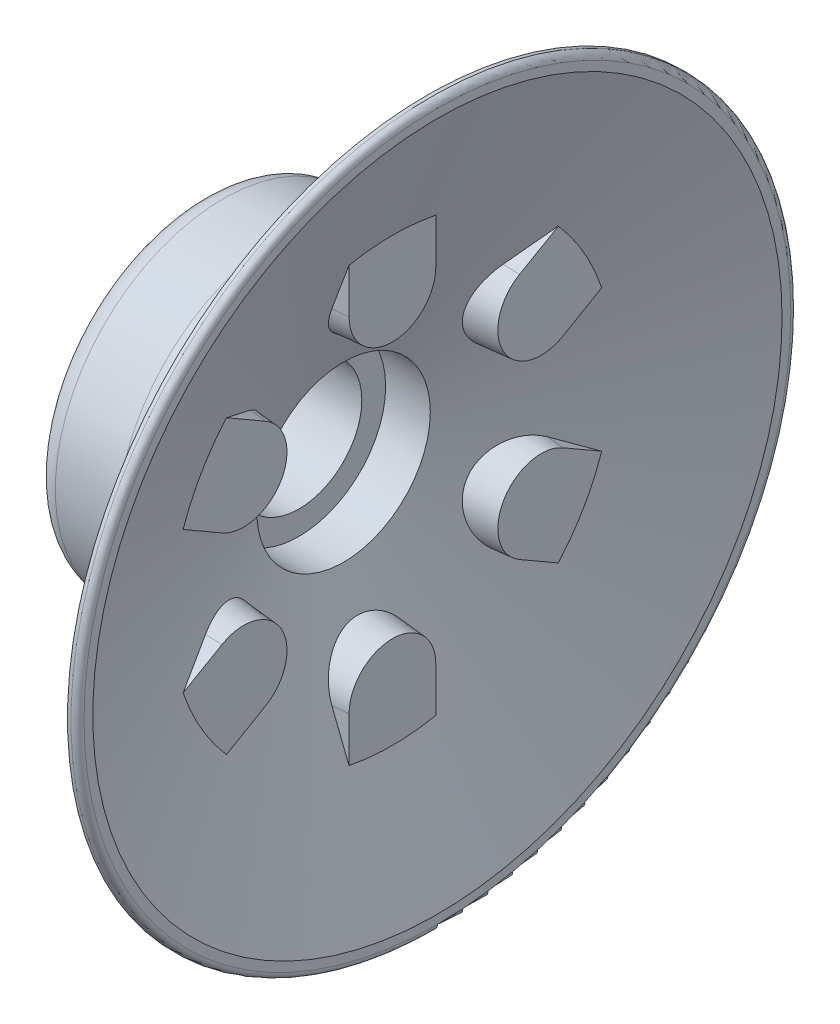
ISO-10303-21;
HEADER;
FILE_DESCRIPTION(('STEP AP214'),'2;1');
FILE_NAME('part.step','',(''),(''),'','','');
FILE_SCHEMA(('AUTOMOTIVE_DESIGN { 1 0 10303 214 1 1 1 1 }'));
ENDSEC;
DATA;
#1=APPLICATION_CONTEXT('core data for automotive mechanical design processes');
#2=APPLICATION_PROTOCOL_DEFINITION('international standard','automotive_design',2000,#1);
#3=PRODUCT_CONTEXT('',#1,'mechanical');
#4=PRODUCT('Part','Part','',(#3));
#5=PRODUCT_RELATED_PRODUCT_CATEGORY('part','',(#4));
#6=PRODUCT_DEFINITION_FORMATION('','',#4);
#7=PRODUCT_DEFINITION_CONTEXT('part definition',#1,'design');
#8=PRODUCT_DEFINITION('design','',#6,#7);
#9=PRODUCT_DEFINITION_SHAPE('','',#8);
#10=(LENGTH_UNIT() NAMED_UNIT(*) SI_UNIT(.MILLI.,.METRE.));
#11=(NAMED_UNIT(*) PLANE_ANGLE_UNIT() SI_UNIT($,.RADIAN.));
#12=(NAMED_UNIT(*) SI_UNIT($,.STERADIAN.) SOLID_ANGLE_UNIT());
#13=UNCERTAINTY_MEASURE_WITH_UNIT(LENGTH_MEASURE(1.E-05),#10,'distance_accuracy_value','');
#14=(GEOMETRIC_REPRESENTATION_CONTEXT(3) GLOBAL_UNCERTAINTY_ASSIGNED_CONTEXT((#13)) GLOBAL_UNIT_ASSIGNED_CONTEXT((#10,
#11,#12)) REPRESENTATION_CONTEXT('',''));
#15=CARTESIAN_POINT('',(0.,0.,0.));
#16=DIRECTION('',(0.,0.,1.));
#17=DIRECTION('',(1.,0.,0.));
#18=AXIS2_PLACEMENT_3D('',#15,#16,#17);
#19=CARTESIAN_POINT('',(0.,0.,0.));
#20=DIRECTION('',(1.,0.,0.));
#21=DIRECTION('',(0.,0.,-1.));
#22=AXIS2_PLACEMENT_3D('',#19,#20,#21);
#23=PLANE('',#22);
#24=CARTESIAN_POINT('',(0.,0.,0.));
#25=DIRECTION('',(1.,0.,0.));
#26=DIRECTION('',(0.,0.,-1.));
#27=AXIS2_PLACEMENT_3D('',#24,#25,#26);
#28=CIRCLE('',#27,20.18538);
#29=CARTESIAN_POINT('',(0.,0.,-20.18538));
#30=VERTEX_POINT('',#29);
#31=EDGE_CURVE('E281',#30,#30,#28,.T.);
#32=ORIENTED_EDGE('',*,*,#31,.F.);
#33=EDGE_LOOP('',(#32));
#34=FACE_BOUND('',#33,.T.);
#35=CARTESIAN_POINT('',(0.,0.,0.));
#36=DIRECTION('',(1.,0.,0.));
#37=DIRECTION('',(0.,0.,-1.));
#38=AXIS2_PLACEMENT_3D('',#35,#36,#37);
#39=CIRCLE('',#38,20.701);
#40=CARTESIAN_POINT('',(0.,0.,-20.701));
#41=VERTEX_POINT('',#40);
#42=EDGE_CURVE('E10',#41,#41,#39,.T.);
#43=ORIENTED_EDGE('',*,*,#42,.T.);
#44=EDGE_LOOP('',(#43));
#45=FACE_BOUND('',#44,.T.);
#46=ADVANCED_FACE('F16',(#34,#45),#23,.T.);
#47=CARTESIAN_POINT('',(-0.381,0.,0.));
#48=DIRECTION('',(1.,0.,0.));
#49=DIRECTION('',(0.,0.,-1.));
#50=AXIS2_PLACEMENT_3D('',#47,#48,#49);
#51=TOROIDAL_SURFACE('',#50,20.701,0.381);
#52=CARTESIAN_POINT('',(-0.381000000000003,0.,0.));
#53=DIRECTION('',(1.,0.,0.));
#54=DIRECTION('',(0.,0.,-1.));
#55=AXIS2_PLACEMENT_3D('',#52,#53,#54);
#56=CIRCLE('',#55,21.082);
#57=CARTESIAN_POINT('',(-0.381000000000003,0.,-21.082));
#58=VERTEX_POINT('',#57);
#59=EDGE_CURVE('E24',#58,#58,#56,.T.);
#60=ORIENTED_EDGE('',*,*,#59,.T.);
#61=EDGE_LOOP('',(#60));
#62=FACE_BOUND('',#61,.T.);
#63=ORIENTED_EDGE('',*,*,#42,.F.);
#64=EDGE_LOOP('',(#63));
#65=FACE_BOUND('',#64,.T.);
#66=ADVANCED_FACE('F270',(#62,#65),#51,.T.);
#67=CARTESIAN_POINT('',(0.,0.,0.));
#68=DIRECTION('',(1.,0.,0.));
#69=DIRECTION('',(0.,0.,-1.));
#70=AXIS2_PLACEMENT_3D('',#67,#68,#69);
#71=CYLINDRICAL_SURFACE('',#70,21.082);
#72=CARTESIAN_POINT('',(-0.58674,0.,0.));
#73=DIRECTION('',(1.,0.,0.));
#74=DIRECTION('',(0.,0.,-1.));
#75=AXIS2_PLACEMENT_3D('',#72,#73,#74);
#76=CIRCLE('',#75,21.082);
#77=CARTESIAN_POINT('',(-0.58674,0.,-21.082));
#78=VERTEX_POINT('',#77);
#79=EDGE_CURVE('E313',#78,#78,#76,.T.);
#80=ORIENTED_EDGE('',*,*,#79,.T.);
#81=EDGE_LOOP('',(#80));
#82=FACE_BOUND('',#81,.T.);
#83=ORIENTED_EDGE('',*,*,#59,.F.);
#84=EDGE_LOOP('',(#83));
#85=FACE_BOUND('',#84,.T.);
#86=ADVANCED_FACE('F276',(#82,#85),#71,.T.);
#87=CARTESIAN_POINT('',(-0.58674,0.,0.));
#88=DIRECTION('',(1.,0.,0.));
#89=DIRECTION('',(0.,0.,-1.));
#90=AXIS2_PLACEMENT_3D('',#87,#88,#89);
#91=CONICAL_SURFACE('',#90,21.082,1.04719755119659);
#92=CARTESIAN_POINT('',(-6.09333366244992,0.,0.));
#93=DIRECTION('',(1.,0.,0.));
#94=DIRECTION('',(0.,0.,-1.));
#95=AXIS2_PLACEMENT_3D('',#92,#93,#94);
#96=CIRCLE('',#95,11.5443);
#97=CARTESIAN_POINT('',(-6.09333366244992,0.,-11.5443));
#98=VERTEX_POINT('',#97);
#99=EDGE_CURVE('E309',#98,#98,#96,.T.);
#100=ORIENTED_EDGE('',*,*,#99,.T.);
#101=EDGE_LOOP('',(#100));
#102=FACE_BOUND('',#101,.T.);
#103=ORIENTED_EDGE('',*,*,#79,.F.);
#104=EDGE_LOOP('',(#103));
#105=FACE_BOUND('',#104,.T.);
#106=ADVANCED_FACE('F324',(#102,#105),#91,.T.);
#107=CARTESIAN_POINT('',(-8.84296431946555,0.,0.));
#108=DIRECTION('',(1.,0.,0.));
#109=DIRECTION('',(0.,0.,-1.));
#110=AXIS2_PLACEMENT_3D('',#107,#108,#109);
#111=TOROIDAL_SURFACE('',#110,13.1318,3.17499999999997);
#112=CARTESIAN_POINT('',(-8.84296428,0.,0.));
#113=DIRECTION('',(1.,0.,0.));
#114=DIRECTION('',(0.,0.,-1.));
#115=AXIS2_PLACEMENT_3D('',#112,#113,#114);
#116=CIRCLE('',#115,9.95680000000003);
#117=CARTESIAN_POINT('',(-8.84296428,0.,-9.95680000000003));
#118=VERTEX_POINT('',#117);
#119=EDGE_CURVE('E305',#118,#118,#116,.T.);
#120=ORIENTED_EDGE('',*,*,#119,.T.);
#121=EDGE_LOOP('',(#120));
#122=FACE_BOUND('',#121,.T.);
#123=ORIENTED_EDGE('',*,*,#99,.F.);
#124=EDGE_LOOP('',(#123));
#125=FACE_BOUND('',#124,.T.);
#126=ADVANCED_FACE('F331',(#122,#125),#111,.F.);
#127=CARTESIAN_POINT('',(-8.84296428,0.,0.));
#128=DIRECTION('',(1.,0.,0.));
#129=DIRECTION('',(0.,0.,-1.));
#130=AXIS2_PLACEMENT_3D('',#127,#128,#129);
#131=CONICAL_SURFACE('',#130,9.95680000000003,0.0349065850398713);
#132=CARTESIAN_POINT('',(-12.5575145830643,0.,0.));
#133=DIRECTION('',(1.,0.,0.));
#134=DIRECTION('',(0.,0.,-1.));
#135=AXIS2_PLACEMENT_3D('',#132,#133,#134);
#136=CIRCLE('',#135,9.82708504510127);
#137=CARTESIAN_POINT('',(-12.5575145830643,0.,-9.82708504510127));
#138=VERTEX_POINT('',#137);
#139=EDGE_CURVE('E295',#138,#138,#136,.T.);
#140=ORIENTED_EDGE('',*,*,#139,.T.);
#141=EDGE_LOOP('',(#140));
#142=FACE_BOUND('',#141,.T.);
#143=ORIENTED_EDGE('',*,*,#119,.F.);
#144=EDGE_LOOP('',(#143));
#145=FACE_BOUND('',#144,.T.);
#146=ADVANCED_FACE('F337',(#142,#145),#131,.T.);
#147=CARTESIAN_POINT('',(-12.5088250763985,0.,0.));
#148=DIRECTION('',(1.,0.,0.));
#149=DIRECTION('',(0.,0.,-1.));
#150=AXIS2_PLACEMENT_3D('',#147,#148,#149);
#151=TOROIDAL_SURFACE('',#150,8.43279999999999,1.39513492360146);
#152=CARTESIAN_POINT('',(-13.90396,0.,0.));
#153=DIRECTION('',(1.,0.,0.));
#154=DIRECTION('',(0.,0.,-1.));
#155=AXIS2_PLACEMENT_3D('',#152,#153,#154);
#156=CIRCLE('',#155,8.43279999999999);
#157=CARTESIAN_POINT('',(-13.90396,0.,-8.43279999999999));
#158=VERTEX_POINT('',#157);
#159=EDGE_CURVE('E286',#158,#158,#156,.T.);
#160=ORIENTED_EDGE('',*,*,#159,.T.);
#161=EDGE_LOOP('',(#160));
#162=FACE_BOUND('',#161,.T.);
#163=ORIENTED_EDGE('',*,*,#139,.F.);
#164=EDGE_LOOP('',(#163));
#165=FACE_BOUND('',#164,.T.);
#166=ADVANCED_FACE('F341',(#162,#165),#151,.T.);
#167=CARTESIAN_POINT('',(-13.90396,8.43279999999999,0.));
#168=DIRECTION('',(-1.,0.,0.));
#169=DIRECTION('',(0.,0.,1.));
#170=AXIS2_PLACEMENT_3D('',#167,#168,#169);
#171=PLANE('',#170);
#172=CARTESIAN_POINT('',(-13.90396,0.,0.));
#173=DIRECTION('',(1.,0.,0.));
#174=DIRECTION('',(0.,0.,-1.));
#175=AXIS2_PLACEMENT_3D('',#172,#173,#174);
#176=CIRCLE('',#175,5.08);
#177=CARTESIAN_POINT('',(-13.90396,0.,-5.08));
#178=VERTEX_POINT('',#177);
#179=EDGE_CURVE('E814',#178,#178,#176,.T.);
#180=ORIENTED_EDGE('',*,*,#179,.T.);
#181=EDGE_LOOP('',(#180));
#182=FACE_BOUND('',#181,.T.);
#183=ORIENTED_EDGE('',*,*,#159,.F.);
#184=EDGE_LOOP('',(#183));
#185=FACE_BOUND('',#184,.T.);
#186=ADVANCED_FACE('F345',(#182,#185),#171,.T.);
#187=CARTESIAN_POINT('',(0.,0.,0.));
#188=DIRECTION('',(1.,0.,0.));
#189=DIRECTION('',(0.,0.,-1.));
#190=AXIS2_PLACEMENT_3D('',#187,#188,#189);
#191=CONICAL_SURFACE('',#190,20.18538,1.22173047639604);
#192=CARTESIAN_POINT('',(-5.4979086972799,0.,0.));
#193=DIRECTION('',(1.,0.,0.));
#194=DIRECTION('',(0.,0.,-1.));
#195=AXIS2_PLACEMENT_3D('',#192,#193,#194);
#196=CIRCLE('',#195,5.08);
#197=CARTESIAN_POINT('',(-5.4979086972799,0.,-5.08));
#198=VERTEX_POINT('',#197);
#199=EDGE_CURVE('E1253',#198,#198,#196,.T.);
#200=ORIENTED_EDGE('',*,*,#199,.F.);
#201=EDGE_LOOP('',(#200));
#202=FACE_BOUND('',#201,.T.);
#203=CARTESIAN_POINT('',(-2.63632,4.14554001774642,12.2602509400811));
#204=CARTESIAN_POINT('',(-2.71531600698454,4.02818908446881,12.0708156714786));
#205=CARTESIAN_POINT('',(-2.79421944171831,3.91082860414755,11.8813476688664));
#206=CARTESIAN_POINT('',(-2.95180413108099,3.67608507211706,11.5023336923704));
#207=CARTESIAN_POINT('',(-3.03048538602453,3.55870202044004,11.3127877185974));
#208=CARTESIAN_POINT('',(-3.18758893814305,3.3239094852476,10.9336046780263));
#209=CARTESIAN_POINT('',(-3.26601123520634,3.2065000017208,10.7439676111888));
#210=CARTESIAN_POINT('',(-3.42254543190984,2.97164949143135,10.3645845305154));
#211=CARTESIAN_POINT('',(-3.50065733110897,2.85420846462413,10.1748385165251));
#212=CARTESIAN_POINT('',(-3.57858821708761,2.73674925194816,9.98502933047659));
#213=B_SPLINE_CURVE_WITH_KNOTS('',3,(#203,#204,#205,#206,#207,#208,#209,#210,#211,#212),
.UNSPECIFIED.,.F.,.F.,(4,2,2,2,4),(0.,0.709278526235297,1.4185560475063,2.12783387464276,
2.83711270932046),.UNSPECIFIED.);
#214=CARTESIAN_POINT('',(-2.63652,4.14524291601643,12.2597713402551));
#215=VERTEX_POINT('',#214);
#216=CARTESIAN_POINT('',(-3.56188357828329,2.76192307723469,10.0257087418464));
#217=VERTEX_POINT('',#216);
#218=EDGE_CURVE('E194',#215,#217,#213,.T.);
#219=ORIENTED_EDGE('',*,*,#218,.F.);
#220=CARTESIAN_POINT('',(-2.63652,0.,0.));
#221=DIRECTION('',(1.,0.,0.));
#222=DIRECTION('',(0.,0.,-1.));
#223=AXIS2_PLACEMENT_3D('',#220,#221,#222);
#224=CIRCLE('',#223,12.9416008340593);
#225=CARTESIAN_POINT('',(-2.63652,8.54465196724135,9.71977134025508));
#226=VERTEX_POINT('',#225);
#227=EDGE_CURVE('E200',#226,#215,#224,.T.);
#228=ORIENTED_EDGE('',*,*,#227,.F.);
#229=CARTESIAN_POINT('',(-3.61373486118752,7.23124452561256,7.27389247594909));
#230=CARTESIAN_POINT('',(-3.53293229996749,7.34088141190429,7.47792774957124));
#231=CARTESIAN_POINT('',(-3.451929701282,7.45046791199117,7.6819107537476));
#232=CARTESIAN_POINT('',(-3.28958348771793,7.66955460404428,8.0897869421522));
#233=CARTESIAN_POINT('',(-3.2082398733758,7.77905479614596,8.29368012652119));
#234=CARTESIAN_POINT('',(-3.04527047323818,7.99798362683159,8.70139193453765));
#235=CARTESIAN_POINT('',(-2.96364468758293,8.10741226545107,8.90521055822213));
#236=CARTESIAN_POINT('',(-2.80015242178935,8.3262086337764,9.31278442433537));
#237=CARTESIAN_POINT('',(-2.71828594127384,8.4355763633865,9.51653966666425));
#238=CARTESIAN_POINT('',(-2.63632,8.54491876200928,9.72026843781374));
#239=B_SPLINE_CURVE_WITH_KNOTS('',3,(#229,#230,#231,#232,#233,#234,#235,#236,#237,#238),
.UNSPECIFIED.,.F.,.F.,(4,2,2,2,4),(0.,0.735946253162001,1.47189134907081,2.20783607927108,
2.94378196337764),.UNSPECIFIED.);
#240=CARTESIAN_POINT('',(-3.56188357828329,7.30155692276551,7.40474991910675));
#241=VERTEX_POINT('',#240);
#242=EDGE_CURVE('E184',#241,#226,#239,.T.);
#243=ORIENTED_EDGE('',*,*,#242,.F.);
#244=CARTESIAN_POINT('',(-3.36806511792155,3.11544221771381,10.4783597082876));
#245=CARTESIAN_POINT('',(-3.39353578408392,3.06032060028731,10.4217384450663));
#246=CARTESIAN_POINT('',(-3.41947643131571,3.00787985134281,10.3627854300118));
#247=CARTESIAN_POINT('',(-3.47216686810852,2.90863668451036,10.2406685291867));
#248=CARTESIAN_POINT('',(-3.4989164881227,2.86183309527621,10.1775055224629));
#249=CARTESIAN_POINT('',(-3.58008866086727,2.73043839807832,9.98260791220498));
#250=CARTESIAN_POINT('',(-3.63553915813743,2.65463703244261,9.84523078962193));
#251=CARTESIAN_POINT('',(-3.74772359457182,2.52857628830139,9.55987387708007));
#252=CARTESIAN_POINT('',(-3.8044571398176,2.47830917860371,9.41189731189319));
#253=CARTESIAN_POINT('',(-3.91779774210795,2.40447378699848,9.10932413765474));
#254=CARTESIAN_POINT('',(-3.97440477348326,2.38091050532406,8.9547262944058));
#255=CARTESIAN_POINT('',(-4.08664087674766,2.36120563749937,8.64067224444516));
#256=CARTESIAN_POINT('',(-4.14224076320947,2.36549913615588,8.48117786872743));
#257=CARTESIAN_POINT('',(-4.2493996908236,2.40302896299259,8.16416689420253));
#258=CARTESIAN_POINT('',(-4.30095830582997,2.43626833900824,8.00665050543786));
#259=CARTESIAN_POINT('',(-4.39605483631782,2.53035227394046,7.70284948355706));
#260=CARTESIAN_POINT('',(-4.43977984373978,2.59038087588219,7.55637252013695));
#261=CARTESIAN_POINT('',(-4.51817480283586,2.73712838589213,7.27478236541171));
#262=CARTESIAN_POINT('',(-4.552851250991,2.82382804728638,7.13966106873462));
#263=CARTESIAN_POINT('',(-4.60781609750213,3.01356473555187,6.89696312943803));
#264=CARTESIAN_POINT('',(-4.62908307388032,3.11456413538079,6.78801820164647));
#265=CARTESIAN_POINT('',(-4.65978314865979,3.33463513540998,6.58825482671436));
#266=CARTESIAN_POINT('',(-4.66922595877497,3.45369181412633,6.4974215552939));
#267=CARTESIAN_POINT('',(-4.67507703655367,3.69369100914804,6.3451473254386));
#268=CARTESIAN_POINT('',(-4.6726510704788,3.81335200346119,6.28172025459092));
#269=CARTESIAN_POINT('',(-4.65761281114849,4.06050515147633,6.17436870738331));
#270=CARTESIAN_POINT('',(-4.64500128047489,4.18799671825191,6.13044277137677));
#271=CARTESIAN_POINT('',(-4.61091994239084,4.44445751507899,6.06357468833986));
#272=CARTESIAN_POINT('',(-4.58962837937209,4.5733489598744,6.04023859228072));
#273=CARTESIAN_POINT('',(-4.53959487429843,4.83171302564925,6.01300809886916));
#274=CARTESIAN_POINT('',(-4.51085114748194,4.96118577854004,6.00911836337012));
#275=CARTESIAN_POINT('',(-4.44522745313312,5.22681041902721,6.02054391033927));
#276=CARTESIAN_POINT('',(-4.40791919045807,5.36279653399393,6.03722069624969));
#277=CARTESIAN_POINT('',(-4.32832920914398,5.62916642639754,6.09092558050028));
#278=CARTESIAN_POINT('',(-4.2860455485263,5.75954798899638,6.1279616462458));
#279=CARTESIAN_POINT('',(-4.19385005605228,6.02435293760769,6.2254939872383));
#280=CARTESIAN_POINT('',(-4.1435958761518,6.15795164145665,6.28790972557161));
#281=CARTESIAN_POINT('',(-4.04081737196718,6.41234890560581,6.43351458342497));
#282=CARTESIAN_POINT('',(-3.98829225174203,6.53314292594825,6.51671103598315));
#283=CARTESIAN_POINT('',(-3.87898335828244,6.76667348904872,6.7077866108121));
#284=CARTESIAN_POINT('',(-3.82214728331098,6.87835232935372,6.81693223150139));
#285=CARTESIAN_POINT('',(-3.70917810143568,7.08100049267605,7.05333455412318));
#286=CARTESIAN_POINT('',(-3.65304509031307,7.17196702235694,7.18059369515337));
#287=CARTESIAN_POINT('',(-3.54199603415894,7.33163096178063,7.45192445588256));
#288=CARTESIAN_POINT('',(-3.48711246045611,7.3999603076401,7.59622662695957));
#289=CARTESIAN_POINT('',(-3.3807962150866,7.50980177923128,7.89591474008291));
#290=CARTESIAN_POINT('',(-3.32936329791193,7.55131581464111,8.05129989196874));
#291=CARTESIAN_POINT('',(-3.23242777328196,7.6047965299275,8.36437952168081));
#292=CARTESIAN_POINT('',(-3.18680650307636,7.61749703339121,8.52191131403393));
#293=CARTESIAN_POINT('',(-3.10104122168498,7.61428845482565,8.83820389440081));
#294=CARTESIAN_POINT('',(-3.06089613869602,7.59838497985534,8.99696443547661));
#295=CARTESIAN_POINT('',(-2.9887848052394,7.53907275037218,9.30307169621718));
#296=CARTESIAN_POINT('',(-2.95652413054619,7.49698333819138,9.4506051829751));
#297=CARTESIAN_POINT('',(-2.89863420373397,7.3871279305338,9.73710820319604));
#298=CARTESIAN_POINT('',(-2.87299794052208,7.31938927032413,9.87608667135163));
#299=CARTESIAN_POINT('',(-2.83691995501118,7.18875090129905,10.0929269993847));
#300=CARTESIAN_POINT('',(-2.82433208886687,7.13290731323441,10.1747621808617));
#301=CARTESIAN_POINT('',(-2.80224364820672,7.01214800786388,10.3317901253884));
#302=CARTESIAN_POINT('',(-2.79274072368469,6.94723925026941,10.4069879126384));
#303=CARTESIAN_POINT('',(-2.78482869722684,6.87810245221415,10.4783597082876));
#304=B_SPLINE_CURVE_WITH_KNOTS('',3,(#244,#245,#246,#247,#248,#249,#250,#251,#252,#253,#254,
#255,#256,#257,#258,#259,#260,#261,#262,#263,#264,#265,#266,#267,#268,#269,#270,#271,#272,#273,
#274,#275,#276,#277,#278,#279,#280,#281,#282,#283,#284,#285,#286,#287,#288,#289,#290,#291,#292,
#293,#294,#295,#296,#297,#298,#299,#300,#301,#302,#303),.UNSPECIFIED.,.F.,.F.,(4,2,2,2,2,2,2,2,
2,2,2,2,2,2,2,2,2,2,2,2,2,2,2,2,2,2,2,2,2,4),(0.,0.248910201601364,0.497768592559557,
0.994472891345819,1.49102670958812,1.98767349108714,2.49209568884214,2.9965710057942,
3.48663097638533,3.97633813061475,4.42406560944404,4.871425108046,5.2757792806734,
5.68010318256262,6.0765119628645,6.47301576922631,6.89723654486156,7.321623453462,
7.78697519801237,8.25249138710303,8.7487264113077,9.24502831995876,9.74904343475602,
10.2530226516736,10.7440151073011,11.2349113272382,11.7028799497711,12.1703512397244,
12.4693285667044,12.7680776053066),.UNSPECIFIED.);
#305=EDGE_CURVE('E721',#217,#241,#304,.T.);
#306=ORIENTED_EDGE('',*,*,#305,.F.);
#307=EDGE_LOOP('',(#219,#228,#243,#306));
#308=FACE_BOUND('',#307,.T.);
#309=CARTESIAN_POINT('',(-2.63632,-8.54491876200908,9.72026843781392));
#310=CARTESIAN_POINT('',(-2.71828594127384,-8.4355763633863,9.51653966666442));
#311=CARTESIAN_POINT('',(-2.80015242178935,-8.32620863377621,9.31278442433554));
#312=CARTESIAN_POINT('',(-2.96364468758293,-8.10741226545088,8.9052105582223));
#313=CARTESIAN_POINT('',(-3.04527047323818,-7.99798362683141,8.70139193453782));
#314=CARTESIAN_POINT('',(-3.2082398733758,-7.77905479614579,8.29368012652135));
#315=CARTESIAN_POINT('',(-3.28958348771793,-7.66955460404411,8.08978694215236));
#316=CARTESIAN_POINT('',(-3.451929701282,-7.45046791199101,7.68191075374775));
#317=CARTESIAN_POINT('',(-3.5329322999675,-7.34088141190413,7.47792774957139));
#318=CARTESIAN_POINT('',(-3.61373486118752,-7.23124452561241,7.27389247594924));
#319=B_SPLINE_CURVE_WITH_KNOTS('',3,(#309,#310,#311,#312,#313,#314,#315,#316,#317,#318),
.UNSPECIFIED.,.F.,.F.,(4,2,2,2,4),(0.,0.735945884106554,1.47189061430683,2.20783571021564,
2.94378196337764),.UNSPECIFIED.);
#320=CARTESIAN_POINT('',(-2.63652,-8.54465196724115,9.71977134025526));
#321=VERTEX_POINT('',#320);
#322=CARTESIAN_POINT('',(-3.56188357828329,-7.30155692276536,7.4047499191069));
#323=VERTEX_POINT('',#322);
#324=EDGE_CURVE('E218',#321,#323,#319,.T.);
#325=ORIENTED_EDGE('',*,*,#324,.F.);
#326=CARTESIAN_POINT('',(-2.63652,0.,0.));
#327=DIRECTION('',(1.,0.,0.));
#328=DIRECTION('',(0.,0.,-1.));
#329=AXIS2_PLACEMENT_3D('',#326,#327,#328);
#330=CIRCLE('',#329,12.9416008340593);
#331=CARTESIAN_POINT('',(-2.63652,-4.14524291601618,12.2597713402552));
#332=VERTEX_POINT('',#331);
#333=EDGE_CURVE('E930',#332,#321,#330,.T.);
#334=ORIENTED_EDGE('',*,*,#333,.F.);
#335=CARTESIAN_POINT('',(-3.57858821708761,-2.73674925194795,9.98502933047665));
#336=CARTESIAN_POINT('',(-3.50065733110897,-2.85420846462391,10.1748385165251));
#337=CARTESIAN_POINT('',(-3.42254543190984,-2.97164949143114,10.3645845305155));
#338=CARTESIAN_POINT('',(-3.26601123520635,-3.20650000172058,10.7439676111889));
#339=CARTESIAN_POINT('',(-3.18758893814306,-3.32390948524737,10.9336046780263));
#340=CARTESIAN_POINT('',(-3.03048538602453,-3.5587020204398,11.3127877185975));
#341=CARTESIAN_POINT('',(-2.95180413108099,-3.67608507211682,11.5023336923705));
#342=CARTESIAN_POINT('',(-2.79421944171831,-3.91082860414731,11.8813476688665));
#343=CARTESIAN_POINT('',(-2.71531600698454,-4.02818908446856,12.0708156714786));
#344=CARTESIAN_POINT('',(-2.63632,-4.14554001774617,12.2602509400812));
#345=B_SPLINE_CURVE_WITH_KNOTS('',3,(#335,#336,#337,#338,#339,#340,#341,#342,#343,#344),
.UNSPECIFIED.,.F.,.F.,(4,2,2,2,4),(0.,0.709278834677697,1.41855666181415,2.12783418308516,
2.83711270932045),.UNSPECIFIED.);
#346=CARTESIAN_POINT('',(-3.56188357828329,-2.76192307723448,10.0257087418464));
#347=VERTEX_POINT('',#346);
#348=EDGE_CURVE('E210',#347,#332,#345,.T.);
#349=ORIENTED_EDGE('',*,*,#348,.F.);
#350=CARTESIAN_POINT('',(-2.78482869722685,-6.87810245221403,10.4783597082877));
#351=CARTESIAN_POINT('',(-2.79060854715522,-6.92860315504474,10.4262198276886));
#352=CARTESIAN_POINT('',(-2.79723989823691,-6.9768693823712,10.3720205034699));
#353=CARTESIAN_POINT('',(-2.81215964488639,-7.06863522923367,10.2599582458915));
#354=CARTESIAN_POINT('',(-2.82044768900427,-7.11213585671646,10.2020960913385));
#355=CARTESIAN_POINT('',(-2.8386168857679,-7.19400228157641,10.0832748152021));
#356=CARTESIAN_POINT('',(-2.84849441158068,-7.23237941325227,10.0223229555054));
#357=CARTESIAN_POINT('',(-2.86979587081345,-7.30388487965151,9.8976927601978));
#358=CARTESIAN_POINT('',(-2.88121984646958,-7.33701307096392,9.83401435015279));
#359=CARTESIAN_POINT('',(-2.91771718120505,-7.42821091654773,9.63963892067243));
#360=CARTESIAN_POINT('',(-2.94503822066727,-7.47819398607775,9.50545553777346));
#361=CARTESIAN_POINT('',(-3.00506267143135,-7.5555603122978,9.23195047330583));
#362=CARTESIAN_POINT('',(-3.03776764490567,-7.58293699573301,9.09262730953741));
#363=CARTESIAN_POINT('',(-3.10901382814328,-7.61548475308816,8.80824623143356));
#364=CARTESIAN_POINT('',(-3.14770396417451,-7.61994470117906,8.66314400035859));
#365=CARTESIAN_POINT('',(-3.22936780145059,-7.60526599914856,8.37536703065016));
#366=CARTESIAN_POINT('',(-3.2723426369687,-7.58612108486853,8.2326929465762));
#367=CARTESIAN_POINT('',(-3.36388761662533,-7.52386957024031,7.94671870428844));
#368=CARTESIAN_POINT('',(-3.41262661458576,-7.47966741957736,7.80371104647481));
#369=CARTESIAN_POINT('',(-3.51291030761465,-7.3683118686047,7.52799849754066));
#370=CARTESIAN_POINT('',(-3.56445553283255,-7.30115411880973,7.39529556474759));
#371=CARTESIAN_POINT('',(-3.6716381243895,-7.14251719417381,7.13778626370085));
#372=CARTESIAN_POINT('',(-3.72735532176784,-7.05008170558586,7.01360162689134));
#373=CARTESIAN_POINT('',(-3.83933981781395,-6.84518893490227,6.78328527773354));
#374=CARTESIAN_POINT('',(-3.89560723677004,-6.73272717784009,6.67715761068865));
#375=CARTESIAN_POINT('',(-4.00857276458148,-6.4876735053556,6.48340208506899));
#376=CARTESIAN_POINT('',(-4.06524535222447,-6.35464189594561,6.39631415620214));
#377=CARTESIAN_POINT('',(-4.17559189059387,-6.07412151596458,6.2469447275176));
#378=CARTESIAN_POINT('',(-4.22926550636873,-5.92663113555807,6.18466599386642));
#379=CARTESIAN_POINT('',(-4.3304305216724,-5.62351223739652,6.0882371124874));
#380=CARTESIAN_POINT('',(-4.37800636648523,-5.46804959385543,6.05365711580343));
#381=CARTESIAN_POINT('',(-4.46524574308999,-5.15123411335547,6.01316900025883));
#382=CARTESIAN_POINT('',(-4.5049130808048,-4.9898841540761,6.00724705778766));
#383=CARTESIAN_POINT('',(-4.5708248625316,-4.67847816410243,6.02494623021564));
#384=CARTESIAN_POINT('',(-4.59784380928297,-4.52846732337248,6.04641955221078));
#385=CARTESIAN_POINT('',(-4.64025785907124,-4.23295983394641,6.11565417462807));
#386=CARTESIAN_POINT('',(-4.65566394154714,-4.0874590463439,6.1633905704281));
#387=CARTESIAN_POINT('',(-4.67245691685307,-3.8207725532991,6.27788930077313));
#388=CARTESIAN_POINT('',(-4.67511015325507,-3.69861887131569,6.34222313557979));
#389=CARTESIAN_POINT('',(-4.66961633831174,-3.46622044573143,6.48927479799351));
#390=CARTESIAN_POINT('',(-4.6614716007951,-3.35597315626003,6.57198868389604));
#391=CARTESIAN_POINT('',(-4.6356437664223,-3.15496081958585,6.7491226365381));
#392=CARTESIAN_POINT('',(-4.6183819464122,-3.06356574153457,6.84289361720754));
#393=CARTESIAN_POINT('',(-4.57580588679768,-2.8965261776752,7.04189973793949));
#394=CARTESIAN_POINT('',(-4.55049019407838,-2.82088453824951,7.14713694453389));
#395=CARTESIAN_POINT('',(-4.49174960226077,-2.68294851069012,7.37210295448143));
#396=CARTESIAN_POINT('',(-4.45796350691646,-2.62158396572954,7.4923057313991));
#397=CARTESIAN_POINT('',(-4.38483960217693,-2.51831778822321,7.73919285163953));
#398=CARTESIAN_POINT('',(-4.34549961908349,-2.47642380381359,7.86587972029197));
#399=CARTESIAN_POINT('',(-4.25887278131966,-2.40923145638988,8.13531027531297));
#400=CARTESIAN_POINT('',(-4.21118537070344,-2.38592656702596,8.27842306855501));
#401=CARTESIAN_POINT('',(-4.11288112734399,-2.36288700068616,8.56553442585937));
#402=CARTESIAN_POINT('',(-4.06226325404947,-2.36316074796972,8.70953328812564));
#403=CARTESIAN_POINT('',(-3.95570685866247,-2.38780319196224,9.00603810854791));
#404=CARTESIAN_POINT('',(-3.89965720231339,-2.41401023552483,9.15835400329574));
#405=CARTESIAN_POINT('',(-3.78758301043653,-2.49242933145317,9.45611974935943));
#406=CARTESIAN_POINT('',(-3.73155847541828,-2.54464188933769,9.60156946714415));
#407=CARTESIAN_POINT('',(-3.62280754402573,-2.67163323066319,9.87687641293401));
#408=CARTESIAN_POINT('',(-3.57003393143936,-2.74557667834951,10.0070973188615));
#409=CARTESIAN_POINT('',(-3.49274683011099,-2.87252480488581,10.1921042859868));
#410=CARTESIAN_POINT('',(-3.46727938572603,-2.91755042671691,10.2520911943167));
#411=CARTESIAN_POINT('',(-3.41708675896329,-3.01271810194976,10.368213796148));
#412=CARTESIAN_POINT('',(-3.39236173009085,-3.0628612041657,10.4243486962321));
#413=CARTESIAN_POINT('',(-3.36806511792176,-3.11544221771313,10.4783597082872));
#414=B_SPLINE_CURVE_WITH_KNOTS('',3,(#350,#351,#352,#353,#354,#355,#356,#357,#358,#359,#360,
#361,#362,#363,#364,#365,#366,#367,#368,#369,#370,#371,#372,#373,#374,#375,#376,#377,#378,#379,
#380,#381,#382,#383,#384,#385,#386,#387,#388,#389,#390,#391,#392,#393,#394,#395,#396,#397,#398,
#399,#400,#401,#402,#403,#404,#405,#406,#407,#408,#409,#410,#411,#412,#413),.UNSPECIFIED.,.F.,
.F.,(4,2,2,2,2,2,2,2,2,2,2,2,2,2,2,2,2,2,2,2,2,2,2,2,2,2,2,2,2,2,2,4),(0.,0.218371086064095,
0.436695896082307,0.654529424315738,0.87236890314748,1.30751880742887,1.74279519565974,
2.19150036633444,2.64032463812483,3.11047953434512,3.5807235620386,4.07207312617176,
4.56353262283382,5.06750737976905,5.57153831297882,6.06758697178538,6.56339633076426,
7.02261895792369,7.48140686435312,7.89353876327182,8.30558236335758,8.70006638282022,
9.09462161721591,9.51027193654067,9.92608538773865,10.3820563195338,10.8381901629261,
11.3291553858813,11.8201301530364,12.2942666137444,12.5316699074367,12.7691219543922),.UNSPECIFIED.);
#415=EDGE_CURVE('E248',#323,#347,#414,.T.);
#416=ORIENTED_EDGE('',*,*,#415,.F.);
#417=EDGE_LOOP('',(#325,#334,#349,#416));
#418=FACE_BOUND('',#417,.T.);
#419=CARTESIAN_POINT('',(-2.63632,-12.6904587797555,-2.53998250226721));
#420=CARTESIAN_POINT('',(-2.71391108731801,-12.4716889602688,-2.54677084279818));
#421=CARTESIAN_POINT('',(-2.79141278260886,-12.2528871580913,-2.55355136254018));
#422=CARTESIAN_POINT('',(-2.94620245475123,-11.8152077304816,-2.56709370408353));
#423=CARTESIAN_POINT('',(-3.02349043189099,-11.5963301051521,-2.57385552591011));
#424=CARTESIAN_POINT('',(-3.1778179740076,-11.1584864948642,-2.58735743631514));
#425=CARTESIAN_POINT('',(-3.2548575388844,-10.9395205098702,-2.59409752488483));
#426=CARTESIAN_POINT('',(-3.40864005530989,-10.501483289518,-2.60755175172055));
#427=CARTESIAN_POINT('',(-3.48538300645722,-10.2824120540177,-2.61426588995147));
#428=CARTESIAN_POINT('',(-3.56195346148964,-10.06328,-2.62096493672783));
#429=B_SPLINE_CURVE_WITH_KNOTS('',3,(#419,#420,#421,#422,#423,#424,#425,#426,#427,#428),
.UNSPECIFIED.,.F.,.F.,(4,2,2,2,4),(0.,0.696663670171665,1.39332640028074,2.08998941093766,
2.78665336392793),.UNSPECIFIED.);
#430=CARTESIAN_POINT('',(-2.63652,-12.6898948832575,-2.53999999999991));
#431=VERTEX_POINT('',#430);
#432=CARTESIAN_POINT('',(-3.56188357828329,-10.06348,-2.6209588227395));
#433=VERTEX_POINT('',#432);
#434=EDGE_CURVE('E929',#431,#433,#429,.T.);
#435=ORIENTED_EDGE('',*,*,#434,.F.);
#436=CARTESIAN_POINT('',(-2.63652,0.,0.));
#437=DIRECTION('',(1.,0.,0.));
#438=DIRECTION('',(0.,0.,-1.));
#439=AXIS2_PLACEMENT_3D('',#436,#437,#438);
#440=CIRCLE('',#439,12.9416008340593);
#441=CARTESIAN_POINT('',(-2.63652,-12.6898948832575,2.54000000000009));
#442=VERTEX_POINT('',#441);
#443=EDGE_CURVE('E681',#442,#431,#440,.T.);
#444=ORIENTED_EDGE('',*,*,#443,.F.);
#445=CARTESIAN_POINT('',(-3.56195346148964,-10.06328,2.62096493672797));
#446=CARTESIAN_POINT('',(-3.48538300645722,-10.2824120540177,2.61426588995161));
#447=CARTESIAN_POINT('',(-3.40864005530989,-10.5014832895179,2.6075517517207));
#448=CARTESIAN_POINT('',(-3.2548575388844,-10.9395205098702,2.59409752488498));
#449=CARTESIAN_POINT('',(-3.1778179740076,-11.1584864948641,2.58735743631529));
#450=CARTESIAN_POINT('',(-3.02349043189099,-11.596330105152,2.57385552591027));
#451=CARTESIAN_POINT('',(-2.94620245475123,-11.8152077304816,2.5670937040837));
#452=CARTESIAN_POINT('',(-2.79141278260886,-12.2528871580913,2.55355136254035));
#453=CARTESIAN_POINT('',(-2.71391108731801,-12.4716889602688,2.54677084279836));
#454=CARTESIAN_POINT('',(-2.63632,-12.6904587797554,2.53998250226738));
#455=B_SPLINE_CURVE_WITH_KNOTS('',3,(#445,#446,#447,#448,#449,#450,#451,#452,#453,#454),
.UNSPECIFIED.,.F.,.F.,(4,2,2,2,4),(0.,0.696663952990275,1.39332696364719,2.08998969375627,
2.78665336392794),.UNSPECIFIED.);
#456=CARTESIAN_POINT('',(-3.56188357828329,-10.06348,2.62095882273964));
#457=VERTEX_POINT('',#456);
#458=EDGE_CURVE('E926',#457,#442,#455,.T.);
#459=ORIENTED_EDGE('',*,*,#458,.F.);
#460=CARTESIAN_POINT('',(-3.5618136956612,-10.06368,-2.62095270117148));
#461=CARTESIAN_POINT('',(-3.58950574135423,-9.98442281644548,-2.62337907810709));
#462=CARTESIAN_POINT('',(-3.61748826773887,-9.90520435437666,-2.62223885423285));
#463=CARTESIAN_POINT('',(-3.67388346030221,-9.74734798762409,-2.61289082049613));
#464=CARTESIAN_POINT('',(-3.70229608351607,-9.6687100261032,-2.60468371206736));
#465=CARTESIAN_POINT('',(-3.78790913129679,-9.43454034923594,-2.56958148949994));
#466=CARTESIAN_POINT('',(-3.84553582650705,-9.28060635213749,-2.53220965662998));
#467=CARTESIAN_POINT('',(-3.96022061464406,-8.98168921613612,-2.43063420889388));
#468=CARTESIAN_POINT('',(-4.01727858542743,-8.83670796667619,-2.36642495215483));
#469=CARTESIAN_POINT('',(-4.12899329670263,-8.55979173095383,-2.21267411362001));
#470=CARTESIAN_POINT('',(-4.18365023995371,-8.42785564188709,-2.12313467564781));
#471=CARTESIAN_POINT('',(-4.28787817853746,-8.18221232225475,-1.92152422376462));
#472=CARTESIAN_POINT('',(-4.33748865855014,-8.06835889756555,-1.80965237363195));
#473=CARTESIAN_POINT('',(-4.42953374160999,-7.8616022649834,-1.56537226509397));
#474=CARTESIAN_POINT('',(-4.4719701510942,-7.76869378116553,-1.43296919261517));
#475=CARTESIAN_POINT('',(-4.54421827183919,-7.61321117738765,-1.16037586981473));
#476=CARTESIAN_POINT('',(-4.57467630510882,-7.54904498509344,-1.02126895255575));
#477=CARTESIAN_POINT('',(-4.62424047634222,-7.44572345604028,-0.732194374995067));
#478=CARTESIAN_POINT('',(-4.64335802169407,-7.40654298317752,-0.582237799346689));
#479=CARTESIAN_POINT('',(-4.66711780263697,-7.35802096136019,-0.292372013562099));
#480=CARTESIAN_POINT('',(-4.67304235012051,-7.34603370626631,-0.153007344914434));
#481=CARTESIAN_POINT('',(-4.67375499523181,-7.34458654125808,0.125849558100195));
#482=CARTESIAN_POINT('',(-4.66854659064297,-7.35511955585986,0.26534173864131));
#483=CARTESIAN_POINT('',(-4.64805569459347,-7.39693741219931,0.532333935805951));
#484=CARTESIAN_POINT('',(-4.63335137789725,-7.42703186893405,0.660068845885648));
#485=CARTESIAN_POINT('',(-4.59550800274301,-7.50549162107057,0.90845752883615));
#486=CARTESIAN_POINT('',(-4.57236763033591,-7.5538597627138,1.02911019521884));
#487=CARTESIAN_POINT('',(-4.51796408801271,-7.66945403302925,1.26552519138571));
#488=CARTESIAN_POINT('',(-4.48640246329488,-7.7373823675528,1.38087385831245));
#489=CARTESIAN_POINT('',(-4.41737900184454,-7.88888934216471,1.59879333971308));
#490=CARTESIAN_POINT('',(-4.37991526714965,-7.97247301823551,1.70136002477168));
#491=CARTESIAN_POINT('',(-4.29692632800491,-8.16157658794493,1.90106818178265));
#492=CARTESIAN_POINT('',(-4.25097362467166,-8.26842460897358,1.99677461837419));
#493=CARTESIAN_POINT('',(-4.1557304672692,-8.49521825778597,2.16917402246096));
#494=CARTESIAN_POINT('',(-4.10643803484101,-8.61517167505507,2.24585559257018));
#495=CARTESIAN_POINT('',(-4.00194696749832,-8.87550827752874,2.38430557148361));
#496=CARTESIAN_POINT('',(-3.94659615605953,-9.01676036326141,2.44432684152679));
#497=CARTESIAN_POINT('',(-3.83551131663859,-9.30727851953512,2.53907905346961));
#498=CARTESIAN_POINT('',(-3.77977765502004,-9.45653766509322,2.57383148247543));
#499=CARTESIAN_POINT('',(-3.69708023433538,-9.68312095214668,2.60628198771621));
#500=CARTESIAN_POINT('',(-3.669699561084,-9.75899854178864,2.6138220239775));
#501=CARTESIAN_POINT('',(-3.61539442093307,-9.91113334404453,2.62231964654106));
#502=CARTESIAN_POINT('',(-3.58846924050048,-9.98738966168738,2.62328871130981));
#503=CARTESIAN_POINT('',(-3.56181369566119,-10.06368,2.62095270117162));
#504=B_SPLINE_CURVE_WITH_KNOTS('',3,(#460,#461,#462,#463,#464,#465,#466,#467,#468,#469,#470,
#471,#472,#473,#474,#475,#476,#477,#478,#479,#480,#481,#482,#483,#484,#485,#486,#487,#488,#489,
#490,#491,#492,#493,#494,#495,#496,#497,#498,#499,#500,#501,#502,#503),.UNSPECIFIED.,.F.,.F.,(4,
2,2,2,2,2,2,2,2,2,2,2,2,2,2,2,2,2,2,2,2,4),(0.,0.251810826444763,0.503596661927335,
1.00670865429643,1.5099264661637,2.01310170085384,2.51197534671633,3.01072318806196,
3.47669935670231,3.94220600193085,4.36002262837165,4.7777080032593,5.1720934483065,
5.56654034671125,5.97743394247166,6.38845994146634,6.83843392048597,7.28867682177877,
7.7759812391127,8.26287079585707,8.50569205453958,8.74808903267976),.UNSPECIFIED.);
#505=EDGE_CURVE('E752',#433,#457,#504,.T.);
#506=ORIENTED_EDGE('',*,*,#505,.F.);
#507=EDGE_LOOP('',(#435,#444,#459,#506));
#508=FACE_BOUND('',#507,.T.);
#509=CARTESIAN_POINT('',(-2.63632,-4.14554001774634,-12.2602509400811));
#510=CARTESIAN_POINT('',(-2.71531600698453,-4.02818908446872,-12.0708156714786));
#511=CARTESIAN_POINT('',(-2.79421944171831,-3.91082860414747,-11.8813476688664));
#512=CARTESIAN_POINT('',(-2.95180413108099,-3.67608507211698,-11.5023336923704));
#513=CARTESIAN_POINT('',(-3.03048538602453,-3.55870202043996,-11.3127877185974));
#514=CARTESIAN_POINT('',(-3.18758893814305,-3.32390948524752,-10.9336046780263));
#515=CARTESIAN_POINT('',(-3.26601123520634,-3.20650000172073,-10.7439676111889));
#516=CARTESIAN_POINT('',(-3.42254543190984,-2.97164949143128,-10.3645845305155));
#517=CARTESIAN_POINT('',(-3.50065733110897,-2.85420846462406,-10.1748385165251));
#518=CARTESIAN_POINT('',(-3.57858821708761,-2.73674925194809,-9.98502933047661));
#519=B_SPLINE_CURVE_WITH_KNOTS('',3,(#509,#510,#511,#512,#513,#514,#515,#516,#517,#518),
.UNSPECIFIED.,.F.,.F.,(4,2,2,2,4),(0.,0.709278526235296,1.4185560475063,2.12783387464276,
2.83711270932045),.UNSPECIFIED.);
#520=CARTESIAN_POINT('',(-2.63652,-4.14524291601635,-12.2597713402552));
#521=VERTEX_POINT('',#520);
#522=CARTESIAN_POINT('',(-3.56188357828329,-2.76192307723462,-10.0257087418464));
#523=VERTEX_POINT('',#522);
#524=EDGE_CURVE('E668',#521,#523,#519,.T.);
#525=ORIENTED_EDGE('',*,*,#524,.F.);
#526=CARTESIAN_POINT('',(-2.63652,0.,0.));
#527=DIRECTION('',(1.,0.,0.));
#528=DIRECTION('',(0.,0.,-1.));
#529=AXIS2_PLACEMENT_3D('',#526,#527,#528);
#530=CIRCLE('',#529,12.9416008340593);
#531=CARTESIAN_POINT('',(-2.63652,-8.54465196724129,-9.71977134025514));
#532=VERTEX_POINT('',#531);
#533=EDGE_CURVE('E500',#532,#521,#530,.T.);
#534=ORIENTED_EDGE('',*,*,#533,.F.);
#535=CARTESIAN_POINT('',(-3.61373486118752,-7.23124452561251,-7.27389247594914));
#536=CARTESIAN_POINT('',(-3.53293229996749,-7.34088141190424,-7.47792774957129));
#537=CARTESIAN_POINT('',(-3.451929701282,-7.45046791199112,-7.68191075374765));
#538=CARTESIAN_POINT('',(-3.28958348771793,-7.66955460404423,-8.08978694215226));
#539=CARTESIAN_POINT('',(-3.2082398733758,-7.77905479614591,-8.29368012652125));
#540=CARTESIAN_POINT('',(-3.04527047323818,-7.99798362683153,-8.70139193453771));
#541=CARTESIAN_POINT('',(-2.96364468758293,-8.107412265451,-8.90521055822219));
#542=CARTESIAN_POINT('',(-2.80015242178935,-8.32620863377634,-9.31278442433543));
#543=CARTESIAN_POINT('',(-2.71828594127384,-8.43557636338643,-9.51653966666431));
#544=CARTESIAN_POINT('',(-2.63632,-8.54491876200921,-9.7202684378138));
#545=B_SPLINE_CURVE_WITH_KNOTS('',3,(#535,#536,#537,#538,#539,#540,#541,#542,#543,#544),
.UNSPECIFIED.,.F.,.F.,(4,2,2,2,4),(0.,0.735946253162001,1.47189134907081,2.20783607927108,
2.94378196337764),.UNSPECIFIED.);
#546=CARTESIAN_POINT('',(-3.56188357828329,-7.30155692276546,-7.4047499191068));
#547=VERTEX_POINT('',#546);
#548=EDGE_CURVE('E674',#547,#532,#545,.T.);
#549=ORIENTED_EDGE('',*,*,#548,.F.);
#550=CARTESIAN_POINT('',(-3.36806511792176,-3.11544221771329,-10.4783597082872));
#551=CARTESIAN_POINT('',(-3.39353578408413,-3.06032060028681,-10.4217384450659));
#552=CARTESIAN_POINT('',(-3.41947643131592,-3.00787985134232,-10.3627854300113));
#553=CARTESIAN_POINT('',(-3.47216686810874,-2.90863668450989,-10.2406685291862));
#554=CARTESIAN_POINT('',(-3.49891648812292,-2.86183309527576,-10.1775055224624));
#555=CARTESIAN_POINT('',(-3.5800886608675,-2.73043839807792,-9.98260791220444));
#556=CARTESIAN_POINT('',(-3.63553915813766,-2.65463703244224,-9.84523078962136));
#557=CARTESIAN_POINT('',(-3.74772359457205,-2.52857628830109,-9.55987387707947));
#558=CARTESIAN_POINT('',(-3.80445713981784,-2.47830917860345,-9.41189731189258));
#559=CARTESIAN_POINT('',(-3.91779774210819,-2.4044737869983,-9.1093241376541));
#560=CARTESIAN_POINT('',(-3.9744047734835,-2.38091050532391,-8.95472629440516));
#561=CARTESIAN_POINT('',(-4.0866408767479,-2.36120563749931,-8.64067224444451));
#562=CARTESIAN_POINT('',(-4.1422407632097,-2.36549913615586,-8.48117786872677));
#563=CARTESIAN_POINT('',(-4.24939969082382,-2.40302896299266,-8.16416689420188));
#564=CARTESIAN_POINT('',(-4.30095830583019,-2.43626833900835,-8.00665050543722));
#565=CARTESIAN_POINT('',(-4.39605483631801,-2.53035227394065,-7.70284948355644));
#566=CARTESIAN_POINT('',(-4.43977984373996,-2.59038087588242,-7.55637252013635));
#567=CARTESIAN_POINT('',(-4.518174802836,-2.73712838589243,-7.27478236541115));
#568=CARTESIAN_POINT('',(-4.55285125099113,-2.82382804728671,-7.13966106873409));
#569=CARTESIAN_POINT('',(-4.60781609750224,-3.01356473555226,-6.89696312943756));
#570=CARTESIAN_POINT('',(-4.6290830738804,-3.11456413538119,-6.78801820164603));
#571=CARTESIAN_POINT('',(-4.65978314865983,-3.33463513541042,-6.58825482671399));
#572=CARTESIAN_POINT('',(-4.669225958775,-3.45369181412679,-6.49742155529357));
#573=CARTESIAN_POINT('',(-4.67507703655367,-3.69369100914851,-6.34514732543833));
#574=CARTESIAN_POINT('',(-4.67265107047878,-3.81335200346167,-6.28172025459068));
#575=CARTESIAN_POINT('',(-4.65761281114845,-4.06050515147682,-6.17436870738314));
#576=CARTESIAN_POINT('',(-4.64500128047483,-4.1879967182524,-6.13044277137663));
#577=CARTESIAN_POINT('',(-4.61091994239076,-4.4444575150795,-6.06357468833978));
#578=CARTESIAN_POINT('',(-4.589628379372,-4.57334895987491,-6.04023859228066));
#579=CARTESIAN_POINT('',(-4.53959487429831,-4.83171302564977,-6.01300809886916));
#580=CARTESIAN_POINT('',(-4.51085114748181,-4.96118577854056,-6.00911836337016));
#581=CARTESIAN_POINT('',(-4.44522745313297,-5.22681041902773,-6.02054391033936));
#582=CARTESIAN_POINT('',(-4.40791919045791,-5.36279653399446,-6.03722069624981));
#583=CARTESIAN_POINT('',(-4.3283292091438,-5.62916642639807,-6.09092558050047));
#584=CARTESIAN_POINT('',(-4.28604554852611,-5.75954798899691,-6.12796164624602));
#585=CARTESIAN_POINT('',(-4.19385005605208,-6.0243529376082,-6.22549398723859));
#586=CARTESIAN_POINT('',(-4.14359587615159,-6.15795164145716,-6.28790972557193));
#587=CARTESIAN_POINT('',(-4.04081737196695,-6.4123489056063,-6.43351458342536));
#588=CARTESIAN_POINT('',(-3.9882922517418,-6.53314292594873,-6.51671103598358));
#589=CARTESIAN_POINT('',(-3.8789833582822,-6.76667348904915,-6.7077866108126));
#590=CARTESIAN_POINT('',(-3.82214728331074,-6.87835232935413,-6.81693223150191));
#591=CARTESIAN_POINT('',(-3.70917810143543,-7.08100049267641,-7.05333455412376));
#592=CARTESIAN_POINT('',(-3.65304509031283,-7.17196702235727,-7.18059369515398));
#593=CARTESIAN_POINT('',(-3.54199603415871,-7.33163096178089,-7.45192445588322));
#594=CARTESIAN_POINT('',(-3.48711246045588,-7.39996030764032,-7.59622662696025));
#595=CARTESIAN_POINT('',(-3.38079621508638,-7.50980177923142,-7.89591474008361));
#596=CARTESIAN_POINT('',(-3.32936329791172,-7.55131581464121,-8.05129989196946));
#597=CARTESIAN_POINT('',(-3.23242777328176,-7.60479652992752,-8.36437952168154));
#598=CARTESIAN_POINT('',(-3.18680650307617,-7.61749703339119,-8.52191131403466));
#599=CARTESIAN_POINT('',(-3.1010412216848,-7.61428845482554,-8.83820389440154));
#600=CARTESIAN_POINT('',(-3.06089613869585,-7.59838497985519,-8.99696443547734));
#601=CARTESIAN_POINT('',(-2.98878480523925,-7.53907275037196,-9.30307169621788));
#602=CARTESIAN_POINT('',(-2.95652413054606,-7.49698333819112,-9.45060518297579));
#603=CARTESIAN_POINT('',(-2.89863420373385,-7.38712793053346,-9.73710820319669));
#604=CARTESIAN_POINT('',(-2.87299794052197,-7.31938927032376,-9.87608667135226));
#605=CARTESIAN_POINT('',(-2.83691995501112,-7.18875090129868,-10.0929269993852));
#606=CARTESIAN_POINT('',(-2.82433208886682,-7.1329073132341,-10.1747621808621));
#607=CARTESIAN_POINT('',(-2.8022436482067,-7.01214800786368,-10.3317901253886));
#608=CARTESIAN_POINT('',(-2.79274072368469,-6.94723925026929,-10.4069879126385));
#609=CARTESIAN_POINT('',(-2.78482869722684,-6.87810245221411,-10.4783597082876));
#610=B_SPLINE_CURVE_WITH_KNOTS('',3,(#550,#551,#552,#553,#554,#555,#556,#557,#558,#559,#560,
#561,#562,#563,#564,#565,#566,#567,#568,#569,#570,#571,#572,#573,#574,#575,#576,#577,#578,#579,
#580,#581,#582,#583,#584,#585,#586,#587,#588,#589,#590,#591,#592,#593,#594,#595,#596,#597,#598,
#599,#600,#601,#602,#603,#604,#605,#606,#607,#608,#609),.UNSPECIFIED.,.F.,.F.,(4,2,2,2,2,2,2,2,
2,2,2,2,2,2,2,2,2,2,2,2,2,2,2,2,2,2,2,2,2,4),(0.,0.248910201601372,0.497768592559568,
0.99447289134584,1.49102670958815,1.98767349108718,2.49209568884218,2.99657100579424,
3.48663097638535,3.97633813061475,4.424065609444,4.87142510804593,5.2757792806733,
5.68010318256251,6.0765119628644,6.47301576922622,6.89723654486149,7.32162345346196,
7.78697519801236,8.25249138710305,8.74872641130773,9.24502831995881,9.74904343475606,
10.2530226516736,10.7440151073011,11.2349113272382,11.7028799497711,12.1703512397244,
12.469328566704,12.7680776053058),.UNSPECIFIED.);
#611=EDGE_CURVE('E673',#523,#547,#610,.T.);
#612=ORIENTED_EDGE('',*,*,#611,.F.);
#613=EDGE_LOOP('',(#525,#534,#549,#612));
#614=FACE_BOUND('',#613,.T.);
#615=CARTESIAN_POINT('',(-2.63632,8.54491876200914,-9.72026843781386));
#616=CARTESIAN_POINT('',(-2.71828594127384,8.43557636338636,-9.51653966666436));
#617=CARTESIAN_POINT('',(-2.80015242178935,8.32620863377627,-9.31278442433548));
#618=CARTESIAN_POINT('',(-2.96364468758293,8.10741226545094,-8.90521055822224));
#619=CARTESIAN_POINT('',(-3.04527047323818,7.99798362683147,-8.70139193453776));
#620=CARTESIAN_POINT('',(-3.2082398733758,7.77905479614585,-8.2936801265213));
#621=CARTESIAN_POINT('',(-3.28958348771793,7.66955460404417,-8.08978694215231));
#622=CARTESIAN_POINT('',(-3.451929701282,7.45046791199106,-7.6819107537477));
#623=CARTESIAN_POINT('',(-3.53293229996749,7.34088141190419,-7.47792774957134));
#624=CARTESIAN_POINT('',(-3.61373486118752,7.23124452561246,-7.27389247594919));
#625=B_SPLINE_CURVE_WITH_KNOTS('',3,(#615,#616,#617,#618,#619,#620,#621,#622,#623,#624),
.UNSPECIFIED.,.F.,.F.,(4,2,2,2,4),(0.,0.735945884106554,1.47189061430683,2.20783571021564,
2.94378196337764),.UNSPECIFIED.);
#626=CARTESIAN_POINT('',(-2.63652,8.54465196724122,-9.7197713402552));
#627=VERTEX_POINT('',#626);
#628=CARTESIAN_POINT('',(-3.56188357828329,7.30155692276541,-7.40474991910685));
#629=VERTEX_POINT('',#628);
#630=EDGE_CURVE('E478',#627,#629,#625,.T.);
#631=ORIENTED_EDGE('',*,*,#630,.F.);
#632=CARTESIAN_POINT('',(-2.63652,0.,0.));
#633=DIRECTION('',(1.,0.,0.));
#634=DIRECTION('',(0.,0.,-1.));
#635=AXIS2_PLACEMENT_3D('',#632,#633,#634);
#636=CIRCLE('',#635,12.9416008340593);
#637=CARTESIAN_POINT('',(-2.63652,4.14524291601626,-12.2597713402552));
#638=VERTEX_POINT('',#637);
#639=EDGE_CURVE('E442',#638,#627,#636,.T.);
#640=ORIENTED_EDGE('',*,*,#639,.F.);
#641=CARTESIAN_POINT('',(-3.57858821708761,2.73674925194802,-9.98502933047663));
#642=CARTESIAN_POINT('',(-3.50065733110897,2.85420846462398,-10.1748385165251));
#643=CARTESIAN_POINT('',(-3.42254543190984,2.97164949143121,-10.3645845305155));
#644=CARTESIAN_POINT('',(-3.26601123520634,3.20650000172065,-10.7439676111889));
#645=CARTESIAN_POINT('',(-3.18758893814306,3.32390948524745,-10.9336046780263));
#646=CARTESIAN_POINT('',(-3.03048538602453,3.55870202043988,-11.3127877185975));
#647=CARTESIAN_POINT('',(-2.95180413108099,3.6760850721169,-11.5023336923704));
#648=CARTESIAN_POINT('',(-2.79421944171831,3.91082860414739,-11.8813476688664));
#649=CARTESIAN_POINT('',(-2.71531600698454,4.02818908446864,-12.0708156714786));
#650=CARTESIAN_POINT('',(-2.63632,4.14554001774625,-12.2602509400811));
#651=B_SPLINE_CURVE_WITH_KNOTS('',3,(#641,#642,#643,#644,#645,#646,#647,#648,#649,#650),
.UNSPECIFIED.,.F.,.F.,(4,2,2,2,4),(0.,0.709278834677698,1.41855666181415,2.12783418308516,
2.83711270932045),.UNSPECIFIED.);
#652=CARTESIAN_POINT('',(-3.56188357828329,2.76192307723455,-10.0257087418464));
#653=VERTEX_POINT('',#652);
#654=EDGE_CURVE('E493',#653,#638,#651,.T.);
#655=ORIENTED_EDGE('',*,*,#654,.F.);
#656=CARTESIAN_POINT('',(-2.78482869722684,6.87810245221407,-10.4783597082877));
#657=CARTESIAN_POINT('',(-2.79060854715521,6.92860315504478,-10.4262198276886));
#658=CARTESIAN_POINT('',(-2.79723989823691,6.97686938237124,-10.3720205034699));
#659=CARTESIAN_POINT('',(-2.81215964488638,7.06863522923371,-10.2599582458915));
#660=CARTESIAN_POINT('',(-2.82044768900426,7.1121358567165,-10.2020960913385));
#661=CARTESIAN_POINT('',(-2.8386168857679,7.19400228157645,-10.0832748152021));
#662=CARTESIAN_POINT('',(-2.84849441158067,7.23237941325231,-10.0223229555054));
#663=CARTESIAN_POINT('',(-2.86979587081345,7.30388487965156,-9.89769276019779));
#664=CARTESIAN_POINT('',(-2.88121984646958,7.33701307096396,-9.83401435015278));
#665=CARTESIAN_POINT('',(-2.91771718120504,7.42821091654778,-9.63963892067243));
#666=CARTESIAN_POINT('',(-2.94503822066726,7.4781939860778,-9.50545553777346));
#667=CARTESIAN_POINT('',(-3.00506267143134,7.55556031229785,-9.23195047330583));
#668=CARTESIAN_POINT('',(-3.03776764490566,7.58293699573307,-9.09262730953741));
#669=CARTESIAN_POINT('',(-3.10901382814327,7.61548475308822,-8.80824623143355));
#670=CARTESIAN_POINT('',(-3.14770396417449,7.61994470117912,-8.66314400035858));
#671=CARTESIAN_POINT('',(-3.22936780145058,7.60526599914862,-8.37536703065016));
#672=CARTESIAN_POINT('',(-3.27234263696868,7.58612108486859,-8.23269294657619));
#673=CARTESIAN_POINT('',(-3.36388761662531,7.52386957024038,-7.94671870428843));
#674=CARTESIAN_POINT('',(-3.41262661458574,7.47966741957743,-7.8037110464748));
#675=CARTESIAN_POINT('',(-3.51291030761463,7.36831186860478,-7.52799849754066));
#676=CARTESIAN_POINT('',(-3.56445553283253,7.30115411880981,-7.39529556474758));
#677=CARTESIAN_POINT('',(-3.67163812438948,7.14251719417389,-7.13778626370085));
#678=CARTESIAN_POINT('',(-3.72735532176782,7.05008170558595,-7.01360162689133));
#679=CARTESIAN_POINT('',(-3.83933981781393,6.84518893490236,-6.78328527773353));
#680=CARTESIAN_POINT('',(-3.89560723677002,6.73272717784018,-6.67715761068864));
#681=CARTESIAN_POINT('',(-4.00857276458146,6.48767350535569,-6.48340208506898));
#682=CARTESIAN_POINT('',(-4.06524535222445,6.3546418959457,-6.39631415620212));
#683=CARTESIAN_POINT('',(-4.17559189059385,6.07412151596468,-6.24694472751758));
#684=CARTESIAN_POINT('',(-4.22926550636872,5.92663113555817,-6.1846659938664));
#685=CARTESIAN_POINT('',(-4.33043052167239,5.62351223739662,-6.08823711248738));
#686=CARTESIAN_POINT('',(-4.37800636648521,5.46804959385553,-6.0536571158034));
#687=CARTESIAN_POINT('',(-4.46524574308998,5.15123411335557,-6.0131690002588));
#688=CARTESIAN_POINT('',(-4.50491308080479,4.9898841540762,-6.00724705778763));
#689=CARTESIAN_POINT('',(-4.57082486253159,4.67847816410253,-6.0249462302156));
#690=CARTESIAN_POINT('',(-4.59784380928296,4.52846732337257,-6.04641955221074));
#691=CARTESIAN_POINT('',(-4.64025785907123,4.23295983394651,-6.11565417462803));
#692=CARTESIAN_POINT('',(-4.65566394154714,4.08745904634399,-6.16339057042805));
#693=CARTESIAN_POINT('',(-4.67245691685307,3.82077255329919,-6.27788930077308));
#694=CARTESIAN_POINT('',(-4.67511015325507,3.69861887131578,-6.34222313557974));
#695=CARTESIAN_POINT('',(-4.66961633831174,3.46622044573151,-6.48927479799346));
#696=CARTESIAN_POINT('',(-4.6614716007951,3.35597315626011,-6.57198868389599));
#697=CARTESIAN_POINT('',(-4.6356437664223,3.15496081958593,-6.74912263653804));
#698=CARTESIAN_POINT('',(-4.61838194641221,3.06356574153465,-6.84289361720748));
#699=CARTESIAN_POINT('',(-4.57580588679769,2.89652617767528,-7.04189973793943));
#700=CARTESIAN_POINT('',(-4.55049019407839,2.82088453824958,-7.14713694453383));
#701=CARTESIAN_POINT('',(-4.49174960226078,2.6829485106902,-7.37210295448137));
#702=CARTESIAN_POINT('',(-4.45796350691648,2.62158396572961,-7.49230573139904));
#703=CARTESIAN_POINT('',(-4.38483960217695,2.51831778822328,-7.73919285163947));
#704=CARTESIAN_POINT('',(-4.3454996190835,2.47642380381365,-7.8658797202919));
#705=CARTESIAN_POINT('',(-4.25887278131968,2.40923145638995,-8.13531027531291));
#706=CARTESIAN_POINT('',(-4.21118537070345,2.38592656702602,-8.27842306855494));
#707=CARTESIAN_POINT('',(-4.11288112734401,2.36288700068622,-8.5655344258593));
#708=CARTESIAN_POINT('',(-4.06226325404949,2.36316074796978,-8.70953328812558));
#709=CARTESIAN_POINT('',(-3.95570685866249,2.3878031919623,-9.00603810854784));
#710=CARTESIAN_POINT('',(-3.89965720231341,2.41401023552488,-9.15835400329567));
#711=CARTESIAN_POINT('',(-3.78758301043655,2.49242933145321,-9.45611974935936));
#712=CARTESIAN_POINT('',(-3.7315584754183,2.54464188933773,-9.60156946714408));
#713=CARTESIAN_POINT('',(-3.62280754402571,2.67163323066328,-9.87687641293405));
#714=CARTESIAN_POINT('',(-3.5700339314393,2.74557667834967,-10.0070973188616));
#715=CARTESIAN_POINT('',(-3.49274683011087,2.87252480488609,-10.1921042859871));
#716=CARTESIAN_POINT('',(-3.46727938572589,2.91755042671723,-10.2520911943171));
#717=CARTESIAN_POINT('',(-3.41708675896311,3.01271810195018,-10.3682137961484));
#718=CARTESIAN_POINT('',(-3.39236173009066,3.06286120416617,-10.4243486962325));
#719=CARTESIAN_POINT('',(-3.36806511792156,3.11544221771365,-10.4783597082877));
#720=B_SPLINE_CURVE_WITH_KNOTS('',3,(#656,#657,#658,#659,#660,#661,#662,#663,#664,#665,#666,
#667,#668,#669,#670,#671,#672,#673,#674,#675,#676,#677,#678,#679,#680,#681,#682,#683,#684,#685,
#686,#687,#688,#689,#690,#691,#692,#693,#694,#695,#696,#697,#698,#699,#700,#701,#702,#703,#704,
#705,#706,#707,#708,#709,#710,#711,#712,#713,#714,#715,#716,#717,#718,#719),.UNSPECIFIED.,.F.,
.F.,(4,2,2,2,2,2,2,2,2,2,2,2,2,2,2,2,2,2,2,2,2,2,2,2,2,2,2,2,2,2,2,4),(0.,0.218371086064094,
0.436695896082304,0.654529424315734,0.872368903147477,1.30751880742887,1.74279519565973,
2.19150036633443,2.64032463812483,3.11047953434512,3.58072356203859,4.07207312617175,
4.56353262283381,5.06750737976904,5.57153831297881,6.06758697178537,6.56339633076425,
7.02261895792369,7.48140686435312,7.89353876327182,8.30558236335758,8.70006638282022,
9.09462161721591,9.51027193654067,9.92608538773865,10.3820563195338,10.8381901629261,
11.3291553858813,11.8201301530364,12.2942666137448,12.5316699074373,12.7691219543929),.UNSPECIFIED.);
#721=EDGE_CURVE('E469',#629,#653,#720,.T.);
#722=ORIENTED_EDGE('',*,*,#721,.F.);
#723=EDGE_LOOP('',(#631,#640,#655,#722));
#724=FACE_BOUND('',#723,.T.);
#725=CARTESIAN_POINT('',(-2.63632,12.6904587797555,2.5399825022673));
#726=CARTESIAN_POINT('',(-2.71391108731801,12.4716889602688,2.54677084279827));
#727=CARTESIAN_POINT('',(-2.79141278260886,12.2528871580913,2.55355136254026));
#728=CARTESIAN_POINT('',(-2.94620245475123,11.8152077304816,2.56709370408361));
#729=CARTESIAN_POINT('',(-3.02349043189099,11.5963301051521,2.57385552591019));
#730=CARTESIAN_POINT('',(-3.1778179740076,11.1584864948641,2.58735743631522));
#731=CARTESIAN_POINT('',(-3.2548575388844,10.9395205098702,2.59409752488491));
#732=CARTESIAN_POINT('',(-3.40864005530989,10.501483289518,2.60755175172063));
#733=CARTESIAN_POINT('',(-3.48538300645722,10.2824120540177,2.61426588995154));
#734=CARTESIAN_POINT('',(-3.56195346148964,10.06328,2.6209649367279));
#735=B_SPLINE_CURVE_WITH_KNOTS('',3,(#725,#726,#727,#728,#729,#730,#731,#732,#733,#734),
.UNSPECIFIED.,.F.,.F.,(4,2,2,2,4),(0.,0.696663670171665,1.39332640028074,2.08998941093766,
2.78665336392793),.UNSPECIFIED.);
#736=CARTESIAN_POINT('',(-2.63652,12.6898948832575,2.54));
#737=VERTEX_POINT('',#736);
#738=CARTESIAN_POINT('',(-3.56188357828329,10.06348,2.62095882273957));
#739=VERTEX_POINT('',#738);
#740=EDGE_CURVE('E364',#737,#739,#735,.T.);
#741=ORIENTED_EDGE('',*,*,#740,.F.);
#742=CARTESIAN_POINT('',(-2.63652,0.,0.));
#743=DIRECTION('',(1.,0.,0.));
#744=DIRECTION('',(0.,0.,-1.));
#745=AXIS2_PLACEMENT_3D('',#742,#743,#744);
#746=CIRCLE('',#745,12.9416008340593);
#747=CARTESIAN_POINT('',(-2.63652,12.6898948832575,-2.54));
#748=VERTEX_POINT('',#747);
#749=EDGE_CURVE('E287',#748,#737,#746,.T.);
#750=ORIENTED_EDGE('',*,*,#749,.F.);
#751=CARTESIAN_POINT('',(-3.56195346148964,10.06328,-2.6209649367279));
#752=CARTESIAN_POINT('',(-3.48538300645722,10.2824120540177,-2.61426588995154));
#753=CARTESIAN_POINT('',(-3.40864005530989,10.501483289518,-2.60755175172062));
#754=CARTESIAN_POINT('',(-3.2548575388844,10.9395205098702,-2.59409752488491));
#755=CARTESIAN_POINT('',(-3.1778179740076,11.1584864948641,-2.58735743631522));
#756=CARTESIAN_POINT('',(-3.02349043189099,11.5963301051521,-2.57385552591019));
#757=CARTESIAN_POINT('',(-2.94620245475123,11.8152077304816,-2.56709370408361));
#758=CARTESIAN_POINT('',(-2.79141278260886,12.2528871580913,-2.55355136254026));
#759=CARTESIAN_POINT('',(-2.71391108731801,12.4716889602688,-2.54677084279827));
#760=CARTESIAN_POINT('',(-2.63632,12.6904587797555,-2.5399825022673));
#761=B_SPLINE_CURVE_WITH_KNOTS('',3,(#751,#752,#753,#754,#755,#756,#757,#758,#759,#760),
.UNSPECIFIED.,.F.,.F.,(4,2,2,2,4),(0.,0.696663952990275,1.39332696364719,2.08998969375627,
2.78665336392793),.UNSPECIFIED.);
#762=CARTESIAN_POINT('',(-3.56188357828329,10.06348,-2.62095882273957));
#763=VERTEX_POINT('',#762);
#764=EDGE_CURVE('E375',#763,#748,#761,.T.);
#765=ORIENTED_EDGE('',*,*,#764,.F.);
#766=CARTESIAN_POINT('',(-3.5618136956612,10.06368,2.62095270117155));
#767=CARTESIAN_POINT('',(-3.58950574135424,9.98442281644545,2.62337907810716));
#768=CARTESIAN_POINT('',(-3.61748826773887,9.90520435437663,2.62223885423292));
#769=CARTESIAN_POINT('',(-3.67388346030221,9.74734798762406,2.61289082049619));
#770=CARTESIAN_POINT('',(-3.70229608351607,9.66871002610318,2.60468371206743));
#771=CARTESIAN_POINT('',(-3.7879091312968,9.43454034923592,2.5695814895));
#772=CARTESIAN_POINT('',(-3.84553582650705,9.28060635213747,2.53220965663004));
#773=CARTESIAN_POINT('',(-3.96022061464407,8.9816892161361,2.43063420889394));
#774=CARTESIAN_POINT('',(-4.01727858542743,8.83670796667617,2.36642495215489));
#775=CARTESIAN_POINT('',(-4.12899329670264,8.55979173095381,2.21267411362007));
#776=CARTESIAN_POINT('',(-4.18365023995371,8.42785564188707,2.12313467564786));
#777=CARTESIAN_POINT('',(-4.28787817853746,8.18221232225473,1.92152422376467));
#778=CARTESIAN_POINT('',(-4.33748865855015,8.06835889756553,1.809652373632));
#779=CARTESIAN_POINT('',(-4.42953374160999,7.86160226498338,1.56537226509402));
#780=CARTESIAN_POINT('',(-4.4719701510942,7.76869378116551,1.43296919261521));
#781=CARTESIAN_POINT('',(-4.5442182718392,7.61321117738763,1.16037586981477));
#782=CARTESIAN_POINT('',(-4.57467630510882,7.54904498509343,1.02126895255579));
#783=CARTESIAN_POINT('',(-4.62424047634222,7.44572345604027,0.732194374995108));
#784=CARTESIAN_POINT('',(-4.64335802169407,7.40654298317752,0.58223779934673));
#785=CARTESIAN_POINT('',(-4.66711780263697,7.35802096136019,0.292372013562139));
#786=CARTESIAN_POINT('',(-4.67304235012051,7.34603370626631,0.153007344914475));
#787=CARTESIAN_POINT('',(-4.67375499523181,7.34458654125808,-0.125849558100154));
#788=CARTESIAN_POINT('',(-4.66854659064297,7.35511955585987,-0.265341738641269));
#789=CARTESIAN_POINT('',(-4.64805569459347,7.39693741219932,-0.532333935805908));
#790=CARTESIAN_POINT('',(-4.63335137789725,7.42703186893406,-0.660068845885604));
#791=CARTESIAN_POINT('',(-4.59550800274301,7.50549162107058,-0.908457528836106));
#792=CARTESIAN_POINT('',(-4.57236763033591,7.55385976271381,-1.0291101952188));
#793=CARTESIAN_POINT('',(-4.51796408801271,7.66945403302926,-1.26552519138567));
#794=CARTESIAN_POINT('',(-4.48640246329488,7.73738236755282,-1.38087385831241));
#795=CARTESIAN_POINT('',(-4.41737900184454,7.88888934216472,-1.59879333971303));
#796=CARTESIAN_POINT('',(-4.37991526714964,7.97247301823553,-1.70136002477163));
#797=CARTESIAN_POINT('',(-4.29692632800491,8.16157658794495,-1.9010681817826));
#798=CARTESIAN_POINT('',(-4.25097362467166,8.2684246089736,-1.99677461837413));
#799=CARTESIAN_POINT('',(-4.1557304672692,8.49521825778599,-2.1691740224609));
#800=CARTESIAN_POINT('',(-4.10643803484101,8.61517167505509,-2.24585559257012));
#801=CARTESIAN_POINT('',(-4.00194696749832,8.87550827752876,-2.38430557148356));
#802=CARTESIAN_POINT('',(-3.94659615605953,9.01676036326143,-2.44432684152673));
#803=CARTESIAN_POINT('',(-3.83551131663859,9.30727851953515,-2.53907905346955));
#804=CARTESIAN_POINT('',(-3.77977765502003,9.45653766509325,-2.57383148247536));
#805=CARTESIAN_POINT('',(-3.69708023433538,9.6831209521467,-2.60628198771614));
#806=CARTESIAN_POINT('',(-3.669699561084,9.75899854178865,-2.61382202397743));
#807=CARTESIAN_POINT('',(-3.61539442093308,9.91113334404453,-2.62231964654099));
#808=CARTESIAN_POINT('',(-3.58846924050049,9.98738966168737,-2.62328871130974));
#809=CARTESIAN_POINT('',(-3.5618136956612,10.06368,-2.62095270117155));
#810=B_SPLINE_CURVE_WITH_KNOTS('',3,(#766,#767,#768,#769,#770,#771,#772,#773,#774,#775,#776,
#777,#778,#779,#780,#781,#782,#783,#784,#785,#786,#787,#788,#789,#790,#791,#792,#793,#794,#795,
#796,#797,#798,#799,#800,#801,#802,#803,#804,#805,#806,#807,#808,#809),.UNSPECIFIED.,.F.,.F.,(4,
2,2,2,2,2,2,2,2,2,2,2,2,2,2,2,2,2,2,2,2,4),(0.,0.251810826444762,0.503596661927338,
1.00670865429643,1.5099264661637,2.01310170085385,2.51197534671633,3.01072318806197,
3.47669935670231,3.94220600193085,4.36002262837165,4.7777080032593,5.1720934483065,
5.56654034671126,5.97743394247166,6.38845994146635,6.83843392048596,7.28867682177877,
7.7759812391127,8.26287079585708,8.50569205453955,8.7480890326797),.UNSPECIFIED.);
#811=EDGE_CURVE('E374',#739,#763,#810,.T.);
#812=ORIENTED_EDGE('',*,*,#811,.F.);
#813=EDGE_LOOP('',(#741,#750,#765,#812));
#814=FACE_BOUND('',#813,.T.);
#815=ORIENTED_EDGE('',*,*,#31,.T.);
#816=EDGE_LOOP('',(#815));
#817=FACE_BOUND('',#816,.T.);
#818=ADVANCED_FACE('F207',(#202,#308,#418,#508,#614,#724,#814,#817),#191,.F.);
#819=CARTESIAN_POINT('',(-2.63652,10.06348,0.));
#820=DIRECTION('',(1.,0.,0.));
#821=DIRECTION('',(0.,0.,-1.));
#822=AXIS2_PLACEMENT_3D('',#819,#820,#821);
#823=PLANE('',#822);
#824=DIRECTION('',(0.,1.,0.));
#825=VECTOR('',#824,1.);
#826=CARTESIAN_POINT('',(-2.63652,15.20698,-2.54));
#827=LINE('',#826,#825);
#828=CARTESIAN_POINT('',(-2.63652,10.06348,-2.54));
#829=VERTEX_POINT('',#828);
#830=EDGE_CURVE('E428',#829,#748,#827,.T.);
#831=ORIENTED_EDGE('',*,*,#830,.T.);
#832=ORIENTED_EDGE('',*,*,#749,.T.);
#833=DIRECTION('',(0.,-1.,0.));
#834=VECTOR('',#833,1.);
#835=CARTESIAN_POINT('',(-2.63652,10.06348,2.54));
#836=LINE('',#835,#834);
#837=CARTESIAN_POINT('',(-2.63652,10.06348,2.54));
#838=VERTEX_POINT('',#837);
#839=EDGE_CURVE('E418',#737,#838,#836,.T.);
#840=ORIENTED_EDGE('',*,*,#839,.T.);
#841=CARTESIAN_POINT('',(-2.63652,10.06348,0.));
#842=DIRECTION('',(1.,0.,0.));
#843=DIRECTION('',(0.,0.,-1.));
#844=AXIS2_PLACEMENT_3D('',#841,#842,#843);
#845=CIRCLE('',#844,2.54);
#846=EDGE_CURVE('E411',#838,#829,#845,.T.);
#847=ORIENTED_EDGE('',*,*,#846,.T.);
#848=EDGE_LOOP('',(#831,#832,#840,#847));
#849=FACE_BOUND('',#848,.T.);
#850=ADVANCED_FACE('F352',(#849),#823,.T.);
#851=CARTESIAN_POINT('',(-2.63652,15.20698,-2.54));
#852=DIRECTION('',(0.0871557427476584,0.,-0.996194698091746));
#853=DIRECTION('',(-0.996194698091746,0.,-0.0871557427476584));
#854=AXIS2_PLACEMENT_3D('',#851,#852,#853);
#855=PLANE('',#854);
#856=DIRECTION('',(-0.996194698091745,0.,-0.0871557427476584));
#857=VECTOR('',#856,1.);
#858=CARTESIAN_POINT('',(-2.63652,10.06348,-2.54));
#859=LINE('',#858,#857);
#860=EDGE_CURVE('E415',#763,#829,#859,.F.);
#861=ORIENTED_EDGE('',*,*,#860,.F.);
#862=ORIENTED_EDGE('',*,*,#764,.T.);
#863=ORIENTED_EDGE('',*,*,#830,.F.);
#864=EDGE_LOOP('',(#861,#862,#863));
#865=FACE_BOUND('',#864,.T.);
#866=ADVANCED_FACE('F359',(#865),#855,.T.);
#867=CARTESIAN_POINT('',(-2.63652,10.06348,2.54));
#868=DIRECTION('',(0.0871557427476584,0.,0.996194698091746));
#869=DIRECTION('',(0.996194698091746,0.,-0.0871557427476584));
#870=AXIS2_PLACEMENT_3D('',#867,#868,#869);
#871=PLANE('',#870);
#872=ORIENTED_EDGE('',*,*,#839,.F.);
#873=ORIENTED_EDGE('',*,*,#740,.T.);
#874=DIRECTION('',(-0.996194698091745,0.,0.0871557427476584));
#875=VECTOR('',#874,1.);
#876=CARTESIAN_POINT('',(-2.63652,10.06348,2.54));
#877=LINE('',#876,#875);
#878=EDGE_CURVE('E298',#739,#838,#877,.F.);
#879=ORIENTED_EDGE('',*,*,#878,.T.);
#880=EDGE_LOOP('',(#872,#873,#879));
#881=FACE_BOUND('',#880,.T.);
#882=ADVANCED_FACE('F354',(#881),#871,.T.);
#883=CARTESIAN_POINT('',(-2.63652,10.06348,0.));
#884=DIRECTION('',(-1.,0.,0.));
#885=DIRECTION('',(0.,0.,-1.));
#886=AXIS2_PLACEMENT_3D('',#883,#884,#885);
#887=CONICAL_SURFACE('',#886,2.54,0.0872664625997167);
#888=ORIENTED_EDGE('',*,*,#878,.F.);
#889=ORIENTED_EDGE('',*,*,#811,.T.);
#890=ORIENTED_EDGE('',*,*,#860,.T.);
#891=ORIENTED_EDGE('',*,*,#846,.F.);
#892=EDGE_LOOP('',(#888,#889,#890,#891));
#893=FACE_BOUND('',#892,.T.);
#894=ADVANCED_FACE('F358',(#893),#887,.T.);
#895=CARTESIAN_POINT('',(-2.63652,5.03173999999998,-8.71522933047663));
#896=DIRECTION('',(1.,0.,0.));
#897=DIRECTION('',(0.,-0.86602540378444,-0.499999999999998));
#898=AXIS2_PLACEMENT_3D('',#895,#896,#897);
#899=PLANE('',#898);
#900=DIRECTION('',(0.,0.499999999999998,-0.86602540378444));
#901=VECTOR('',#900,1.);
#902=CARTESIAN_POINT('',(-2.63652,5.40378547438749,-14.4396309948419));
#903=LINE('',#902,#901);
#904=CARTESIAN_POINT('',(-2.63652,2.8320354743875,-9.98522933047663));
#905=VERTEX_POINT('',#904);
#906=EDGE_CURVE('E463',#905,#638,#903,.T.);
#907=ORIENTED_EDGE('',*,*,#906,.T.);
#908=ORIENTED_EDGE('',*,*,#639,.T.);
#909=DIRECTION('',(0.,-0.499999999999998,0.86602540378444));
#910=VECTOR('',#909,1.);
#911=CARTESIAN_POINT('',(-2.63652,7.23144452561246,-7.44522933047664));
#912=LINE('',#911,#910);
#913=CARTESIAN_POINT('',(-2.63652,7.23144452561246,-7.44522933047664));
#914=VERTEX_POINT('',#913);
#915=EDGE_CURVE('E459',#627,#914,#912,.T.);
#916=ORIENTED_EDGE('',*,*,#915,.T.);
#917=CARTESIAN_POINT('',(-2.63652,5.03173999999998,-8.71522933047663));
#918=DIRECTION('',(1.,0.,0.));
#919=DIRECTION('',(0.,-0.86602540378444,-0.499999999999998));
#920=AXIS2_PLACEMENT_3D('',#917,#918,#919);
#921=CIRCLE('',#920,2.54);
#922=EDGE_CURVE('E465',#914,#905,#921,.T.);
#923=ORIENTED_EDGE('',*,*,#922,.T.);
#924=EDGE_LOOP('',(#907,#908,#916,#923));
#925=FACE_BOUND('',#924,.T.);
#926=ADVANCED_FACE('F398',(#925),#899,.T.);
#927=CARTESIAN_POINT('',(-2.63652,5.40378547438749,-14.4396309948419));
#928=DIRECTION('',(0.0871557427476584,-0.862729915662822,-0.498097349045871));
#929=DIRECTION('',(0.,0.499999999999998,-0.86602540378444));
#930=AXIS2_PLACEMENT_3D('',#927,#928,#929);
#931=PLANE('',#930);
#932=DIRECTION('',(-0.996194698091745,-0.0754790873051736,-0.043577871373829));
#933=VECTOR('',#932,1.);
#934=CARTESIAN_POINT('',(-2.63652,2.8320354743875,-9.98522933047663));
#935=LINE('',#934,#933);
#936=EDGE_CURVE('E455',#653,#905,#935,.F.);
#937=ORIENTED_EDGE('',*,*,#936,.F.);
#938=ORIENTED_EDGE('',*,*,#654,.T.);
#939=ORIENTED_EDGE('',*,*,#906,.F.);
#940=EDGE_LOOP('',(#937,#938,#939));
#941=FACE_BOUND('',#940,.T.);
#942=ADVANCED_FACE('F404',(#941),#931,.T.);
#943=CARTESIAN_POINT('',(-2.63652,7.23144452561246,-7.44522933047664));
#944=DIRECTION('',(0.0871557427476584,0.862729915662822,0.498097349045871));
#945=DIRECTION('',(0.,-0.499999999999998,0.86602540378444));
#946=AXIS2_PLACEMENT_3D('',#943,#944,#945);
#947=PLANE('',#946);
#948=ORIENTED_EDGE('',*,*,#915,.F.);
#949=ORIENTED_EDGE('',*,*,#630,.T.);
#950=DIRECTION('',(-0.996194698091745,0.0754790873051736,0.043577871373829));
#951=VECTOR('',#950,1.);
#952=CARTESIAN_POINT('',(-2.63652,7.23144452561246,-7.44522933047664));
#953=LINE('',#952,#951);
#954=EDGE_CURVE('E446',#629,#914,#953,.F.);
#955=ORIENTED_EDGE('',*,*,#954,.T.);
#956=EDGE_LOOP('',(#948,#949,#955));
#957=FACE_BOUND('',#956,.T.);
#958=ADVANCED_FACE('F389',(#957),#947,.T.);
#959=CARTESIAN_POINT('',(-2.63652,5.03173999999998,-8.71522933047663));
#960=DIRECTION('',(-1.,0.,0.));
#961=DIRECTION('',(0.,-0.86602540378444,-0.499999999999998));
#962=AXIS2_PLACEMENT_3D('',#959,#960,#961);
#963=CONICAL_SURFACE('',#962,2.54,0.0872664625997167);
#964=ORIENTED_EDGE('',*,*,#954,.F.);
#965=ORIENTED_EDGE('',*,*,#721,.T.);
#966=ORIENTED_EDGE('',*,*,#936,.T.);
#967=ORIENTED_EDGE('',*,*,#922,.F.);
#968=EDGE_LOOP('',(#964,#965,#966,#967));
#969=FACE_BOUND('',#968,.T.);
#970=ADVANCED_FACE('F484',(#969),#963,.T.);
#971=CARTESIAN_POINT('',(-2.63652,-5.03174000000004,-8.7152293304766));
#972=DIRECTION('',(1.,0.,0.));
#973=DIRECTION('',(0.,-0.866025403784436,0.500000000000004));
#974=AXIS2_PLACEMENT_3D('',#971,#972,#973);
#975=PLANE('',#974);
#976=DIRECTION('',(0.,-0.500000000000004,-0.866025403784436));
#977=VECTOR('',#976,1.);
#978=CARTESIAN_POINT('',(-2.63652,-9.80319452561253,-11.8996309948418));
#979=LINE('',#978,#977);
#980=CARTESIAN_POINT('',(-2.63652,-7.23144452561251,-7.44522933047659));
#981=VERTEX_POINT('',#980);
#982=EDGE_CURVE('E539',#981,#532,#979,.T.);
#983=ORIENTED_EDGE('',*,*,#982,.T.);
#984=ORIENTED_EDGE('',*,*,#533,.T.);
#985=DIRECTION('',(0.,0.500000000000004,0.866025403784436));
#986=VECTOR('',#985,1.);
#987=CARTESIAN_POINT('',(-2.63652,-2.83203547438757,-9.98522933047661));
#988=LINE('',#987,#986);
#989=CARTESIAN_POINT('',(-2.63652,-2.83203547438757,-9.98522933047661));
#990=VERTEX_POINT('',#989);
#991=EDGE_CURVE('E544',#521,#990,#988,.T.);
#992=ORIENTED_EDGE('',*,*,#991,.T.);
#993=CARTESIAN_POINT('',(-2.63652,-5.03174000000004,-8.7152293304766));
#994=DIRECTION('',(1.,0.,0.));
#995=DIRECTION('',(0.,-0.866025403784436,0.500000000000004));
#996=AXIS2_PLACEMENT_3D('',#993,#994,#995);
#997=CIRCLE('',#996,2.54);
#998=EDGE_CURVE('E545',#990,#981,#997,.T.);
#999=ORIENTED_EDGE('',*,*,#998,.T.);
#1000=EDGE_LOOP('',(#983,#984,#992,#999));
#1001=FACE_BOUND('',#1000,.T.);
#1002=ADVANCED_FACE('F845',(#1001),#975,.T.);
#1003=CARTESIAN_POINT('',(-2.63652,-9.80319452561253,-11.8996309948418));
#1004=DIRECTION('',(0.0871557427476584,-0.862729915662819,0.498097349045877));
#1005=DIRECTION('',(0.,-0.500000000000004,-0.866025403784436));
#1006=AXIS2_PLACEMENT_3D('',#1003,#1004,#1005);
#1007=PLANE('',#1006);
#1008=DIRECTION('',(-0.996194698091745,-0.0754790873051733,0.0435778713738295));
#1009=VECTOR('',#1008,1.);
#1010=CARTESIAN_POINT('',(-2.63652,-7.23144452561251,-7.44522933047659));
#1011=LINE('',#1010,#1009);
#1012=EDGE_CURVE('E619',#547,#981,#1011,.F.);
#1013=ORIENTED_EDGE('',*,*,#1012,.F.);
#1014=ORIENTED_EDGE('',*,*,#548,.T.);
#1015=ORIENTED_EDGE('',*,*,#982,.F.);
#1016=EDGE_LOOP('',(#1013,#1014,#1015));
#1017=FACE_BOUND('',#1016,.T.);
#1018=ADVANCED_FACE('F886',(#1017),#1007,.T.);
#1019=CARTESIAN_POINT('',(-2.63652,-2.83203547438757,-9.98522933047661));
#1020=DIRECTION('',(0.0871557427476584,0.862729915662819,-0.498097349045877));
#1021=DIRECTION('',(0.,0.500000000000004,0.866025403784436));
#1022=AXIS2_PLACEMENT_3D('',#1019,#1020,#1021);
#1023=PLANE('',#1022);
#1024=ORIENTED_EDGE('',*,*,#991,.F.);
#1025=ORIENTED_EDGE('',*,*,#524,.T.);
#1026=DIRECTION('',(-0.996194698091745,0.0754790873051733,-0.0435778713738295));
#1027=VECTOR('',#1026,1.);
#1028=CARTESIAN_POINT('',(-2.63652,-2.83203547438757,-9.98522933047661));
#1029=LINE('',#1028,#1027);
#1030=EDGE_CURVE('E623',#523,#990,#1029,.F.);
#1031=ORIENTED_EDGE('',*,*,#1030,.T.);
#1032=EDGE_LOOP('',(#1024,#1025,#1031));
#1033=FACE_BOUND('',#1032,.T.);
#1034=ADVANCED_FACE('F488',(#1033),#1023,.T.);
#1035=CARTESIAN_POINT('',(-2.63652,-5.03174000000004,-8.7152293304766));
#1036=DIRECTION('',(-1.,0.,0.));
#1037=DIRECTION('',(0.,-0.866025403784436,0.500000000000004));
#1038=AXIS2_PLACEMENT_3D('',#1035,#1036,#1037);
#1039=CONICAL_SURFACE('',#1038,2.54,0.0872664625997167);
#1040=ORIENTED_EDGE('',*,*,#1030,.F.);
#1041=ORIENTED_EDGE('',*,*,#611,.T.);
#1042=ORIENTED_EDGE('',*,*,#1012,.T.);
#1043=ORIENTED_EDGE('',*,*,#998,.F.);
#1044=EDGE_LOOP('',(#1040,#1041,#1042,#1043));
#1045=FACE_BOUND('',#1044,.T.);
#1046=ADVANCED_FACE('F958',(#1045),#1039,.T.);
#1047=CARTESIAN_POINT('',(-2.63652,-10.06348,0.));
#1048=DIRECTION('',(1.,0.,0.));
#1049=DIRECTION('',(0.,0.,1.));
#1050=AXIS2_PLACEMENT_3D('',#1047,#1048,#1049);
#1051=PLANE('',#1050);
#1052=DIRECTION('',(0.,-1.,0.));
#1053=VECTOR('',#1052,1.);
#1054=CARTESIAN_POINT('',(-2.63652,-15.20698,2.54000000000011));
#1055=LINE('',#1054,#1053);
#1056=CARTESIAN_POINT('',(-2.63652,-10.06348,2.54000000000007));
#1057=VERTEX_POINT('',#1056);
#1058=EDGE_CURVE('E756',#1057,#442,#1055,.T.);
#1059=ORIENTED_EDGE('',*,*,#1058,.T.);
#1060=ORIENTED_EDGE('',*,*,#443,.T.);
#1061=DIRECTION('',(0.,1.,0.));
#1062=VECTOR('',#1061,1.);
#1063=CARTESIAN_POINT('',(-2.63652,-10.06348,-2.53999999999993));
#1064=LINE('',#1063,#1062);
#1065=CARTESIAN_POINT('',(-2.63652,-10.06348,-2.53999999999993));
#1066=VERTEX_POINT('',#1065);
#1067=EDGE_CURVE('E761',#431,#1066,#1064,.T.);
#1068=ORIENTED_EDGE('',*,*,#1067,.T.);
#1069=CARTESIAN_POINT('',(-2.63652,-10.06348,0.));
#1070=DIRECTION('',(1.,0.,0.));
#1071=DIRECTION('',(0.,0.,1.));
#1072=AXIS2_PLACEMENT_3D('',#1069,#1070,#1071);
#1073=CIRCLE('',#1072,2.54);
#1074=EDGE_CURVE('E762',#1066,#1057,#1073,.T.);
#1075=ORIENTED_EDGE('',*,*,#1074,.T.);
#1076=EDGE_LOOP('',(#1059,#1060,#1068,#1075));
#1077=FACE_BOUND('',#1076,.T.);
#1078=ADVANCED_FACE('F695',(#1077),#1051,.T.);
#1079=CARTESIAN_POINT('',(-2.63652,-15.20698,2.54000000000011));
#1080=DIRECTION('',(0.0871557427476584,0.,0.996194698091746));
#1081=DIRECTION('',(0.996194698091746,0.,-0.0871557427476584));
#1082=AXIS2_PLACEMENT_3D('',#1079,#1080,#1081);
#1083=PLANE('',#1082);
#1084=DIRECTION('',(-0.996194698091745,0.,0.0871557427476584));
#1085=VECTOR('',#1084,1.);
#1086=CARTESIAN_POINT('',(-2.63652,-10.06348,2.54000000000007));
#1087=LINE('',#1086,#1085);
#1088=EDGE_CURVE('E777',#457,#1057,#1087,.F.);
#1089=ORIENTED_EDGE('',*,*,#1088,.F.);
#1090=ORIENTED_EDGE('',*,*,#458,.T.);
#1091=ORIENTED_EDGE('',*,*,#1058,.F.);
#1092=EDGE_LOOP('',(#1089,#1090,#1091));
#1093=FACE_BOUND('',#1092,.T.);
#1094=ADVANCED_FACE('F629',(#1093),#1083,.T.);
#1095=CARTESIAN_POINT('',(-2.63652,-10.06348,-2.53999999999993));
#1096=DIRECTION('',(0.0871557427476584,0.,-0.996194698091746));
#1097=DIRECTION('',(-0.996194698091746,0.,-0.0871557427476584));
#1098=AXIS2_PLACEMENT_3D('',#1095,#1096,#1097);
#1099=PLANE('',#1098);
#1100=ORIENTED_EDGE('',*,*,#1067,.F.);
#1101=ORIENTED_EDGE('',*,*,#434,.T.);
#1102=DIRECTION('',(-0.996194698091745,0.,-0.0871557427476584));
#1103=VECTOR('',#1102,1.);
#1104=CARTESIAN_POINT('',(-2.63652,-10.06348,-2.53999999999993));
#1105=LINE('',#1104,#1103);
#1106=EDGE_CURVE('E781',#433,#1066,#1105,.F.);
#1107=ORIENTED_EDGE('',*,*,#1106,.T.);
#1108=EDGE_LOOP('',(#1100,#1101,#1107));
#1109=FACE_BOUND('',#1108,.T.);
#1110=ADVANCED_FACE('F556',(#1109),#1099,.T.);
#1111=CARTESIAN_POINT('',(-2.63652,-10.06348,0.));
#1112=DIRECTION('',(-1.,0.,0.));
#1113=DIRECTION('',(0.,0.,1.));
#1114=AXIS2_PLACEMENT_3D('',#1111,#1112,#1113);
#1115=CONICAL_SURFACE('',#1114,2.54,0.0872664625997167);
#1116=ORIENTED_EDGE('',*,*,#1106,.F.);
#1117=ORIENTED_EDGE('',*,*,#505,.T.);
#1118=ORIENTED_EDGE('',*,*,#1088,.T.);
#1119=ORIENTED_EDGE('',*,*,#1074,.F.);
#1120=EDGE_LOOP('',(#1116,#1117,#1118,#1119));
#1121=FACE_BOUND('',#1120,.T.);
#1122=ADVANCED_FACE('F550',(#1121),#1115,.T.);
#1123=CARTESIAN_POINT('',(-2.63652,-5.03173999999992,8.71522933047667));
#1124=DIRECTION('',(1.,0.,0.));
#1125=DIRECTION('',(0.,0.866025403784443,0.499999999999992));
#1126=AXIS2_PLACEMENT_3D('',#1123,#1124,#1125);
#1127=PLANE('',#1126);
#1128=DIRECTION('',(0.,-0.499999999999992,0.866025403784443));
#1129=VECTOR('',#1128,1.);
#1130=CARTESIAN_POINT('',(-2.63652,-5.40378547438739,14.4396309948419));
#1131=LINE('',#1130,#1129);
#1132=CARTESIAN_POINT('',(-2.63652,-2.83203547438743,9.98522933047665));
#1133=VERTEX_POINT('',#1132);
#1134=EDGE_CURVE('E771',#1133,#332,#1131,.T.);
#1135=ORIENTED_EDGE('',*,*,#1134,.T.);
#1136=ORIENTED_EDGE('',*,*,#333,.T.);
#1137=DIRECTION('',(0.,0.499999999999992,-0.866025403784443));
#1138=VECTOR('',#1137,1.);
#1139=CARTESIAN_POINT('',(-2.63652,-7.2314445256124,7.44522933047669));
#1140=LINE('',#1139,#1138);
#1141=CARTESIAN_POINT('',(-2.63652,-7.2314445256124,7.44522933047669));
#1142=VERTEX_POINT('',#1141);
#1143=EDGE_CURVE('E640',#321,#1142,#1140,.T.);
#1144=ORIENTED_EDGE('',*,*,#1143,.T.);
#1145=CARTESIAN_POINT('',(-2.63652,-5.03173999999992,8.71522933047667));
#1146=DIRECTION('',(1.,0.,0.));
#1147=DIRECTION('',(0.,0.866025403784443,0.499999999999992));
#1148=AXIS2_PLACEMENT_3D('',#1145,#1146,#1147);
#1149=CIRCLE('',#1148,2.54);
#1150=EDGE_CURVE('E255',#1142,#1133,#1149,.T.);
#1151=ORIENTED_EDGE('',*,*,#1150,.T.);
#1152=EDGE_LOOP('',(#1135,#1136,#1144,#1151));
#1153=FACE_BOUND('',#1152,.T.);
#1154=ADVANCED_FACE('F245',(#1153),#1127,.T.);
#1155=CARTESIAN_POINT('',(-2.63652,-5.40378547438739,14.4396309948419));
#1156=DIRECTION('',(0.0871557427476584,0.862729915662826,0.498097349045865));
#1157=DIRECTION('',(0.,-0.499999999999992,0.866025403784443));
#1158=AXIS2_PLACEMENT_3D('',#1155,#1156,#1157);
#1159=PLANE('',#1158);
#1160=DIRECTION('',(-0.996194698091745,0.0754790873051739,0.0435778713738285));
#1161=VECTOR('',#1160,1.);
#1162=CARTESIAN_POINT('',(-2.63652,-2.83203547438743,9.98522933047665));
#1163=LINE('',#1162,#1161);
#1164=EDGE_CURVE('E637',#347,#1133,#1163,.F.);
#1165=ORIENTED_EDGE('',*,*,#1164,.F.);
#1166=ORIENTED_EDGE('',*,*,#348,.T.);
#1167=ORIENTED_EDGE('',*,*,#1134,.F.);
#1168=EDGE_LOOP('',(#1165,#1166,#1167));
#1169=FACE_BOUND('',#1168,.T.);
#1170=ADVANCED_FACE('F236',(#1169),#1159,.T.);
#1171=CARTESIAN_POINT('',(-2.63652,-7.2314445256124,7.44522933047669));
#1172=DIRECTION('',(0.0871557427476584,-0.862729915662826,-0.498097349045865));
#1173=DIRECTION('',(0.,0.499999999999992,-0.866025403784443));
#1174=AXIS2_PLACEMENT_3D('',#1171,#1172,#1173);
#1175=PLANE('',#1174);
#1176=ORIENTED_EDGE('',*,*,#1143,.F.);
#1177=ORIENTED_EDGE('',*,*,#324,.T.);
#1178=DIRECTION('',(-0.996194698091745,-0.0754790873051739,-0.0435778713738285));
#1179=VECTOR('',#1178,1.);
#1180=CARTESIAN_POINT('',(-2.63652,-7.2314445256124,7.44522933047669));
#1181=LINE('',#1180,#1179);
#1182=EDGE_CURVE('E46',#323,#1142,#1181,.F.);
#1183=ORIENTED_EDGE('',*,*,#1182,.T.);
#1184=EDGE_LOOP('',(#1176,#1177,#1183));
#1185=FACE_BOUND('',#1184,.T.);
#1186=ADVANCED_FACE('F260',(#1185),#1175,.T.);
#1187=CARTESIAN_POINT('',(-2.63652,-5.03173999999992,8.71522933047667));
#1188=DIRECTION('',(-1.,0.,0.));
#1189=DIRECTION('',(0.,0.866025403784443,0.499999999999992));
#1190=AXIS2_PLACEMENT_3D('',#1187,#1188,#1189);
#1191=CONICAL_SURFACE('',#1190,2.54,0.0872664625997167);
#1192=ORIENTED_EDGE('',*,*,#1182,.F.);
#1193=ORIENTED_EDGE('',*,*,#415,.T.);
#1194=ORIENTED_EDGE('',*,*,#1164,.T.);
#1195=ORIENTED_EDGE('',*,*,#1150,.F.);
#1196=EDGE_LOOP('',(#1192,#1193,#1194,#1195));
#1197=FACE_BOUND('',#1196,.T.);
#1198=ADVANCED_FACE('F257',(#1197),#1191,.T.);
#1199=CARTESIAN_POINT('',(-2.63652,5.0317400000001,8.71522933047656));
#1200=DIRECTION('',(1.,0.,0.));
#1201=DIRECTION('',(0.,0.866025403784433,-0.50000000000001));
#1202=AXIS2_PLACEMENT_3D('',#1199,#1200,#1201);
#1203=PLANE('',#1202);
#1204=DIRECTION('',(0.,0.50000000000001,0.866025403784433));
#1205=VECTOR('',#1204,1.);
#1206=CARTESIAN_POINT('',(-2.63652,9.80319452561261,11.8996309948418));
#1207=LINE('',#1206,#1205);
#1208=CARTESIAN_POINT('',(-2.63652,7.23144452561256,7.44522933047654));
#1209=VERTEX_POINT('',#1208);
#1210=EDGE_CURVE('E187',#1209,#226,#1207,.T.);
#1211=ORIENTED_EDGE('',*,*,#1210,.T.);
#1212=ORIENTED_EDGE('',*,*,#227,.T.);
#1213=DIRECTION('',(0.,-0.50000000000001,-0.866025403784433));
#1214=VECTOR('',#1213,1.);
#1215=CARTESIAN_POINT('',(-2.63652,2.83203547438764,9.98522933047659));
#1216=LINE('',#1215,#1214);
#1217=CARTESIAN_POINT('',(-2.63652,2.83203547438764,9.98522933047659));
#1218=VERTEX_POINT('',#1217);
#1219=EDGE_CURVE('E204',#215,#1218,#1216,.T.);
#1220=ORIENTED_EDGE('',*,*,#1219,.T.);
#1221=CARTESIAN_POINT('',(-2.63652,5.0317400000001,8.71522933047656));
#1222=DIRECTION('',(1.,0.,0.));
#1223=DIRECTION('',(0.,0.866025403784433,-0.50000000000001));
#1224=AXIS2_PLACEMENT_3D('',#1221,#1222,#1223);
#1225=CIRCLE('',#1224,2.54);
#1226=EDGE_CURVE('E202',#1218,#1209,#1225,.T.);
#1227=ORIENTED_EDGE('',*,*,#1226,.T.);
#1228=EDGE_LOOP('',(#1211,#1212,#1220,#1227));
#1229=FACE_BOUND('',#1228,.T.);
#1230=ADVANCED_FACE('F198',(#1229),#1203,.T.);
#1231=CARTESIAN_POINT('',(-2.63652,9.80319452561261,11.8996309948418));
#1232=DIRECTION('',(0.0871557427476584,0.862729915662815,-0.498097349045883));
#1233=DIRECTION('',(0.,0.50000000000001,0.866025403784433));
#1234=AXIS2_PLACEMENT_3D('',#1231,#1232,#1233);
#1235=PLANE('',#1234);
#1236=DIRECTION('',(-0.996194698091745,0.075479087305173,-0.0435778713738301));
#1237=VECTOR('',#1236,1.);
#1238=CARTESIAN_POINT('',(-2.63652,7.23144452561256,7.44522933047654));
#1239=LINE('',#1238,#1237);
#1240=EDGE_CURVE('E189',#241,#1209,#1239,.F.);
#1241=ORIENTED_EDGE('',*,*,#1240,.F.);
#1242=ORIENTED_EDGE('',*,*,#242,.T.);
#1243=ORIENTED_EDGE('',*,*,#1210,.F.);
#1244=EDGE_LOOP('',(#1241,#1242,#1243));
#1245=FACE_BOUND('',#1244,.T.);
#1246=ADVANCED_FACE('F186',(#1245),#1235,.T.);
#1247=CARTESIAN_POINT('',(-2.63652,2.83203547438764,9.98522933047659));
#1248=DIRECTION('',(0.0871557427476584,-0.862729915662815,0.498097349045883));
#1249=DIRECTION('',(0.,-0.50000000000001,-0.866025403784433));
#1250=AXIS2_PLACEMENT_3D('',#1247,#1248,#1249);
#1251=PLANE('',#1250);
#1252=ORIENTED_EDGE('',*,*,#1219,.F.);
#1253=ORIENTED_EDGE('',*,*,#218,.T.);
#1254=DIRECTION('',(-0.996194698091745,-0.075479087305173,0.0435778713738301));
#1255=VECTOR('',#1254,1.);
#1256=CARTESIAN_POINT('',(-2.63652,2.83203547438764,9.98522933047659));
#1257=LINE('',#1256,#1255);
#1258=EDGE_CURVE('E36',#217,#1218,#1257,.F.);
#1259=ORIENTED_EDGE('',*,*,#1258,.T.);
#1260=EDGE_LOOP('',(#1252,#1253,#1259));
#1261=FACE_BOUND('',#1260,.T.);
#1262=ADVANCED_FACE('F242',(#1261),#1251,.T.);
#1263=CARTESIAN_POINT('',(-2.63652,5.0317400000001,8.71522933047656));
#1264=DIRECTION('',(-1.,0.,0.));
#1265=DIRECTION('',(0.,0.866025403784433,-0.50000000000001));
#1266=AXIS2_PLACEMENT_3D('',#1263,#1264,#1265);
#1267=CONICAL_SURFACE('',#1266,2.54,0.0872664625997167);
#1268=ORIENTED_EDGE('',*,*,#1258,.F.);
#1269=ORIENTED_EDGE('',*,*,#305,.T.);
#1270=ORIENTED_EDGE('',*,*,#1240,.T.);
#1271=ORIENTED_EDGE('',*,*,#1226,.F.);
#1272=EDGE_LOOP('',(#1268,#1269,#1270,#1271));
#1273=FACE_BOUND('',#1272,.T.);
#1274=ADVANCED_FACE('F706',(#1273),#1267,.T.);
#1275=CARTESIAN_POINT('',(-12.50696,0.,0.));
#1276=DIRECTION('',(-1.,0.,0.));
#1277=DIRECTION('',(0.,0.,1.));
#1278=AXIS2_PLACEMENT_3D('',#1275,#1276,#1277);
#1279=CONICAL_SURFACE('',#1278,3.683,0.785398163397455);
#1280=ORIENTED_EDGE('',*,*,#179,.F.);
#1281=EDGE_LOOP('',(#1280));
#1282=FACE_BOUND('',#1281,.T.);
#1283=CARTESIAN_POINT('',(-12.50696,0.,0.));
#1284=DIRECTION('',(1.,0.,0.));
#1285=DIRECTION('',(0.,0.,-1.));
#1286=AXIS2_PLACEMENT_3D('',#1283,#1284,#1285);
#1287=CIRCLE('',#1286,3.683);
#1288=CARTESIAN_POINT('',(-12.50696,0.,-3.683));
#1289=VERTEX_POINT('',#1288);
#1290=EDGE_CURVE('E195',#1289,#1289,#1287,.T.);
#1291=ORIENTED_EDGE('',*,*,#1290,.T.);
#1292=EDGE_LOOP('',(#1291));
#1293=FACE_BOUND('',#1292,.T.);
#1294=ADVANCED_FACE('F654',(#1282,#1293),#1279,.F.);
#1295=CARTESIAN_POINT('',(0.,0.,0.));
#1296=DIRECTION('',(1.,0.,0.));
#1297=DIRECTION('',(0.,0.,-1.));
#1298=AXIS2_PLACEMENT_3D('',#1295,#1296,#1297);
#1299=CYLINDRICAL_SURFACE('',#1298,3.683);
#1300=ORIENTED_EDGE('',*,*,#1290,.F.);
#1301=EDGE_LOOP('',(#1300));
#1302=FACE_BOUND('',#1301,.T.);
#1303=CARTESIAN_POINT('',(-8.11276,0.,0.));
#1304=DIRECTION('',(1.,0.,0.));
#1305=DIRECTION('',(0.,0.,-1.));
#1306=AXIS2_PLACEMENT_3D('',#1303,#1304,#1305);
#1307=CIRCLE('',#1306,3.683);
#1308=CARTESIAN_POINT('',(-8.11276,0.,-3.683));
#1309=VERTEX_POINT('',#1308);
#1310=EDGE_CURVE('E813',#1309,#1309,#1307,.T.);
#1311=ORIENTED_EDGE('',*,*,#1310,.T.);
#1312=EDGE_LOOP('',(#1311));
#1313=FACE_BOUND('',#1312,.T.);
#1314=ADVANCED_FACE('F573',(#1302,#1313),#1299,.F.);
#1315=CARTESIAN_POINT('',(-8.11276,5.08,0.));
#1316=DIRECTION('',(-1.,0.,0.));
#1317=DIRECTION('',(0.,0.,1.));
#1318=AXIS2_PLACEMENT_3D('',#1315,#1316,#1317);
#1319=PLANE('',#1318);
#1320=ORIENTED_EDGE('',*,*,#1310,.F.);
#1321=EDGE_LOOP('',(#1320));
#1322=FACE_BOUND('',#1321,.T.);
#1323=CARTESIAN_POINT('',(-8.11276,0.,0.));
#1324=DIRECTION('',(1.,0.,0.));
#1325=DIRECTION('',(0.,0.,-1.));
#1326=AXIS2_PLACEMENT_3D('',#1323,#1324,#1325);
#1327=CIRCLE('',#1326,5.08);
#1328=CARTESIAN_POINT('',(-8.11276,0.,-5.08));
#1329=VERTEX_POINT('',#1328);
#1330=EDGE_CURVE('E809',#1329,#1329,#1327,.T.);
#1331=ORIENTED_EDGE('',*,*,#1330,.T.);
#1332=EDGE_LOOP('',(#1331));
#1333=FACE_BOUND('',#1332,.T.);
#1334=ADVANCED_FACE('F566',(#1322,#1333),#1319,.F.);
#1335=CARTESIAN_POINT('',(0.,0.,0.));
#1336=DIRECTION('',(1.,0.,0.));
#1337=DIRECTION('',(0.,0.,-1.));
#1338=AXIS2_PLACEMENT_3D('',#1335,#1336,#1337);
#1339=CYLINDRICAL_SURFACE('',#1338,5.08);
#1340=ORIENTED_EDGE('',*,*,#1330,.F.);
#1341=EDGE_LOOP('',(#1340));
#1342=FACE_BOUND('',#1341,.T.);
#1343=ORIENTED_EDGE('',*,*,#199,.T.);
#1344=EDGE_LOOP('',(#1343));
#1345=FACE_BOUND('',#1344,.T.);
#1346=ADVANCED_FACE('F572',(#1342,#1345),#1339,.F.);
#1347=CLOSED_SHELL('',(#46,#66,#86,#106,#126,#146,#166,#186,#818,#850,#866,#882,#894,#926,#942,
#958,#970,#1002,#1018,#1034,#1046,#1078,#1094,#1110,#1122,#1154,#1170,#1186,#1198,#1230,#1246,
#1262,#1274,#1294,#1314,#1334,#1346));
#1348=MANIFOLD_SOLID_BREP('B1',#1347);
#1349=ADVANCED_BREP_SHAPE_REPRESENTATION('',(#18,#1348),#14);
#1350=SHAPE_DEFINITION_REPRESENTATION(#9,#1349);
ENDSEC;
END-ISO-10303-21;
